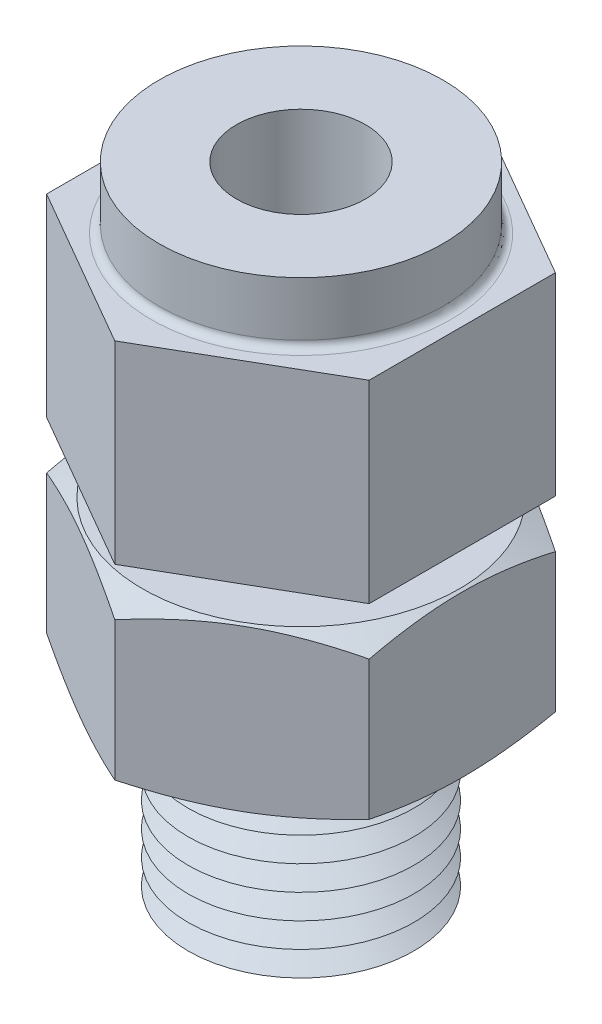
ISO-10303-21;
HEADER;
FILE_DESCRIPTION(('STEP AP214'),'2;1');
FILE_NAME('part.step','',(''),(''),'','','');
FILE_SCHEMA(('AUTOMOTIVE_DESIGN { 1 0 10303 214 1 1 1 1 }'));
ENDSEC;
DATA;
#1=APPLICATION_CONTEXT('core data for automotive mechanical design processes');
#2=APPLICATION_PROTOCOL_DEFINITION('international standard','automotive_design',2000,#1);
#3=PRODUCT_CONTEXT('',#1,'mechanical');
#4=PRODUCT('Part','Part','',(#3));
#5=PRODUCT_RELATED_PRODUCT_CATEGORY('part','',(#4));
#6=PRODUCT_DEFINITION_FORMATION('','',#4);
#7=PRODUCT_DEFINITION_CONTEXT('part definition',#1,'design');
#8=PRODUCT_DEFINITION('design','',#6,#7);
#9=PRODUCT_DEFINITION_SHAPE('','',#8);
#10=(LENGTH_UNIT() NAMED_UNIT(*) SI_UNIT(.MILLI.,.METRE.));
#11=(NAMED_UNIT(*) PLANE_ANGLE_UNIT() SI_UNIT($,.RADIAN.));
#12=(NAMED_UNIT(*) SI_UNIT($,.STERADIAN.) SOLID_ANGLE_UNIT());
#13=UNCERTAINTY_MEASURE_WITH_UNIT(LENGTH_MEASURE(1.E-05),#10,'distance_accuracy_value','');
#14=(GEOMETRIC_REPRESENTATION_CONTEXT(3) GLOBAL_UNCERTAINTY_ASSIGNED_CONTEXT((#13)) GLOBAL_UNIT_ASSIGNED_CONTEXT((#10,
#11,#12)) REPRESENTATION_CONTEXT('',''));
#15=CARTESIAN_POINT('',(0.,0.,0.));
#16=DIRECTION('',(0.,0.,1.));
#17=DIRECTION('',(1.,0.,0.));
#18=AXIS2_PLACEMENT_3D('',#15,#16,#17);
#19=CARTESIAN_POINT('',(0.,22.326593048,0.));
#20=DIRECTION('',(0.,-1.,0.));
#21=DIRECTION('',(0.,0.,-1.));
#22=AXIS2_PLACEMENT_3D('',#19,#20,#21);
#23=CYLINDRICAL_SURFACE('',#22,6.985);
#24=CARTESIAN_POINT('',(0.,19.659593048,0.));
#25=DIRECTION('',(0.,-1.,0.));
#26=DIRECTION('',(0.,0.,-1.));
#27=AXIS2_PLACEMENT_3D('',#24,#25,#26);
#28=CIRCLE('',#27,6.985);
#29=CARTESIAN_POINT('',(0.,19.659593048,-6.98500000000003));
#30=VERTEX_POINT('',#29);
#31=EDGE_CURVE('E38',#30,#30,#28,.F.);
#32=CARTESIAN_POINT('',(0.,22.326593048,0.));
#33=DIRECTION('',(0.,1.,0.));
#34=DIRECTION('',(0.,0.,1.));
#35=AXIS2_PLACEMENT_3D('',#32,#33,#34);
#36=CIRCLE('',#35,6.985);
#37=CARTESIAN_POINT('',(0.,22.326593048,-6.98500000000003));
#38=VERTEX_POINT('',#37);
#39=EDGE_CURVE('E141',#38,#38,#36,.T.);
#40=CARTESIAN_POINT('',(0.,19.659593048,-6.98500000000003));
#41=CARTESIAN_POINT('',(0.,19.687374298,-6.98500000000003));
#42=CARTESIAN_POINT('',(0.,19.715155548,-6.98500000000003));
#43=CARTESIAN_POINT('',(0.,19.770718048,-6.98500000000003));
#44=CARTESIAN_POINT('',(0.,19.798499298,-6.98500000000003));
#45=CARTESIAN_POINT('',(0.,19.854061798,-6.98500000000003));
#46=CARTESIAN_POINT('',(0.,19.881843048,-6.98500000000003));
#47=CARTESIAN_POINT('',(0.,19.937405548,-6.98500000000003));
#48=CARTESIAN_POINT('',(0.,19.965186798,-6.98500000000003));
#49=CARTESIAN_POINT('',(0.,20.020749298,-6.98500000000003));
#50=CARTESIAN_POINT('',(0.,20.048530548,-6.98500000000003));
#51=CARTESIAN_POINT('',(0.,20.104093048,-6.98500000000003));
#52=CARTESIAN_POINT('',(0.,20.131874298,-6.98500000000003));
#53=CARTESIAN_POINT('',(0.,20.187436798,-6.98500000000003));
#54=CARTESIAN_POINT('',(0.,20.215218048,-6.98500000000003));
#55=CARTESIAN_POINT('',(0.,20.270780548,-6.98500000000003));
#56=CARTESIAN_POINT('',(0.,20.298561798,-6.98500000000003));
#57=CARTESIAN_POINT('',(0.,20.354124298,-6.98500000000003));
#58=CARTESIAN_POINT('',(0.,20.381905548,-6.98500000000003));
#59=CARTESIAN_POINT('',(0.,20.437468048,-6.98500000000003));
#60=CARTESIAN_POINT('',(0.,20.465249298,-6.98500000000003));
#61=CARTESIAN_POINT('',(0.,20.520811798,-6.98500000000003));
#62=CARTESIAN_POINT('',(0.,20.548593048,-6.98500000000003));
#63=CARTESIAN_POINT('',(0.,20.604155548,-6.98500000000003));
#64=CARTESIAN_POINT('',(0.,20.631936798,-6.98500000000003));
#65=CARTESIAN_POINT('',(0.,20.687499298,-6.98500000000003));
#66=CARTESIAN_POINT('',(0.,20.715280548,-6.98500000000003));
#67=CARTESIAN_POINT('',(0.,20.770843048,-6.98500000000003));
#68=CARTESIAN_POINT('',(0.,20.798624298,-6.98500000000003));
#69=CARTESIAN_POINT('',(0.,20.854186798,-6.98500000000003));
#70=CARTESIAN_POINT('',(0.,20.881968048,-6.98500000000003));
#71=CARTESIAN_POINT('',(0.,20.937530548,-6.98500000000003));
#72=CARTESIAN_POINT('',(0.,20.965311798,-6.98500000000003));
#73=CARTESIAN_POINT('',(0.,21.020874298,-6.98500000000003));
#74=CARTESIAN_POINT('',(0.,21.048655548,-6.98500000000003));
#75=CARTESIAN_POINT('',(0.,21.104218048,-6.98500000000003));
#76=CARTESIAN_POINT('',(0.,21.131999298,-6.98500000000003));
#77=CARTESIAN_POINT('',(0.,21.187561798,-6.98500000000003));
#78=CARTESIAN_POINT('',(0.,21.215343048,-6.98500000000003));
#79=CARTESIAN_POINT('',(0.,21.270905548,-6.98500000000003));
#80=CARTESIAN_POINT('',(0.,21.298686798,-6.98500000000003));
#81=CARTESIAN_POINT('',(0.,21.354249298,-6.98500000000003));
#82=CARTESIAN_POINT('',(0.,21.382030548,-6.98500000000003));
#83=CARTESIAN_POINT('',(0.,21.437593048,-6.98500000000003));
#84=CARTESIAN_POINT('',(0.,21.465374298,-6.98500000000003));
#85=CARTESIAN_POINT('',(0.,21.520936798,-6.98500000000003));
#86=CARTESIAN_POINT('',(0.,21.548718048,-6.98500000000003));
#87=CARTESIAN_POINT('',(0.,21.604280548,-6.98500000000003));
#88=CARTESIAN_POINT('',(0.,21.632061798,-6.98500000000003));
#89=CARTESIAN_POINT('',(0.,21.687624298,-6.98500000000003));
#90=CARTESIAN_POINT('',(0.,21.715405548,-6.98500000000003));
#91=CARTESIAN_POINT('',(0.,21.770968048,-6.98500000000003));
#92=CARTESIAN_POINT('',(0.,21.798749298,-6.98500000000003));
#93=CARTESIAN_POINT('',(0.,21.854311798,-6.98500000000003));
#94=CARTESIAN_POINT('',(0.,21.882093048,-6.98500000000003));
#95=CARTESIAN_POINT('',(0.,21.937655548,-6.98500000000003));
#96=CARTESIAN_POINT('',(0.,21.965436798,-6.98500000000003));
#97=CARTESIAN_POINT('',(0.,22.020999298,-6.98500000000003));
#98=CARTESIAN_POINT('',(0.,22.048780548,-6.98500000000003));
#99=CARTESIAN_POINT('',(0.,22.104343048,-6.98500000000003));
#100=CARTESIAN_POINT('',(0.,22.132124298,-6.98500000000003));
#101=CARTESIAN_POINT('',(0.,22.187686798,-6.98500000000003));
#102=CARTESIAN_POINT('',(0.,22.215468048,-6.98500000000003));
#103=CARTESIAN_POINT('',(0.,22.271030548,-6.98500000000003));
#104=CARTESIAN_POINT('',(0.,22.298811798,-6.98500000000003));
#105=CARTESIAN_POINT('',(0.,22.326593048,-6.98500000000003));
#106=B_SPLINE_CURVE_WITH_KNOTS('',3,(#40,#41,#42,#43,#44,#45,#46,#47,#48,#49,#50,#51,#52,#53,
#54,#55,#56,#57,#58,#59,#60,#61,#62,#63,#64,#65,#66,#67,#68,#69,#70,#71,#72,#73,#74,#75,#76,#77,
#78,#79,#80,#81,#82,#83,#84,#85,#86,#87,#88,#89,#90,#91,#92,#93,#94,#95,#96,#97,#98,#99,#100,
#101,#102,#103,#104,#105),.UNSPECIFIED.,.F.,.F.,(4,2,2,2,2,2,2,2,2,2,2,2,2,2,2,2,2,2,2,2,2,2,2,
2,2,2,2,2,2,2,2,2,4),(0.,0.0833437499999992,0.166687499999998,0.250031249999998,
0.333374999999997,0.416718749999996,0.500062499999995,0.583406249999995,0.666749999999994,
0.750093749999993,0.833437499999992,0.916781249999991,1.00012499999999,1.08346874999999,
1.16681249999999,1.25015624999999,1.33349999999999,1.41684374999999,1.50018749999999,
1.58353124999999,1.66687499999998,1.75021874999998,1.83356249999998,1.91690624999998,
2.00024999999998,2.08359374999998,2.16693749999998,2.25028124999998,2.33362499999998,
2.41696874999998,2.50031249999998,2.58365624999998,2.66699999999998),.UNSPECIFIED.);
#107=EDGE_CURVE('BSEAM30',#30,#38,#106,.T.);
#108=ORIENTED_EDGE('',*,*,#31,.T.);
#109=ORIENTED_EDGE('',*,*,#39,.F.);
#110=ORIENTED_EDGE('',*,*,#107,.T.);
#111=ORIENTED_EDGE('',*,*,#107,.F.);
#112=EDGE_LOOP('',(#108,#110,#109,#111));
#113=FACE_BOUND('',#112,.T.);
#114=ADVANCED_FACE('F30',(#113),#23,.T.);
#115=CARTESIAN_POINT('',(0.,22.326593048,0.));
#116=DIRECTION('',(0.,1.,0.));
#117=DIRECTION('',(0.,0.,1.));
#118=AXIS2_PLACEMENT_3D('',#115,#116,#117);
#119=PLANE('',#118);
#120=CARTESIAN_POINT('',(0.,22.326593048,0.));
#121=DIRECTION('',(0.,1.,0.));
#122=DIRECTION('',(0.,0.,1.));
#123=AXIS2_PLACEMENT_3D('',#120,#121,#122);
#124=CIRCLE('',#123,3.175);
#125=CARTESIAN_POINT('',(0.,22.326593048,3.17499999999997));
#126=VERTEX_POINT('',#125);
#127=EDGE_CURVE('E658',#126,#126,#124,.T.);
#128=ORIENTED_EDGE('',*,*,#127,.F.);
#129=EDGE_LOOP('',(#128));
#130=FACE_BOUND('',#129,.T.);
#131=ORIENTED_EDGE('',*,*,#39,.T.);
#132=EDGE_LOOP('',(#131));
#133=FACE_BOUND('',#132,.T.);
#134=ADVANCED_FACE('F391',(#130,#133),#119,.T.);
#135=CARTESIAN_POINT('',(15.8749820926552,19.278593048,7.20072985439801E-06));
#136=DIRECTION('',(0.,-1.,0.));
#137=DIRECTION('',(0.,0.,-1.));
#138=AXIS2_PLACEMENT_3D('',#135,#136,#137);
#139=PLANE('',#138);
#140=CARTESIAN_POINT('',(0.,19.278593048,0.));
#141=DIRECTION('',(0.,-1.,0.));
#142=DIRECTION('',(0.,0.,-1.));
#143=AXIS2_PLACEMENT_3D('',#140,#141,#142);
#144=CIRCLE('',#143,7.366);
#145=CARTESIAN_POINT('',(0.,19.278593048,-7.366));
#146=VERTEX_POINT('',#145);
#147=EDGE_CURVE('E11',#146,#146,#144,.T.);
#148=ORIENTED_EDGE('',*,*,#147,.T.);
#149=EDGE_LOOP('',(#148));
#150=FACE_BOUND('',#149,.T.);
#151=DIRECTION('',(0.866025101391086,0.,0.500000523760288));
#152=VECTOR('',#151,1.);
#153=CARTESIAN_POINT('',(6.23601629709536E-06,19.278593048,-9.16542718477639));
#154=LINE('',#153,#152);
#155=CARTESIAN_POINT('',(6.23601629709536E-06,19.278593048,-9.16542718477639));
#156=VERTEX_POINT('',#155);
#157=CARTESIAN_POINT('',(7.93749520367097,19.278593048,-4.58270939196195));
#158=VERTEX_POINT('',#157);
#159=EDGE_CURVE('E124',#156,#158,#154,.T.);
#160=ORIENTED_EDGE('',*,*,#159,.F.);
#161=DIRECTION('',(0.866025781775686,0.,-0.499999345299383));
#162=VECTOR('',#161,1.);
#163=CARTESIAN_POINT('',(-7.93748896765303,19.278593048,-4.58272019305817));
#164=LINE('',#163,#162);
#165=CARTESIAN_POINT('',(-7.93748896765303,19.278593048,-4.58272019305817));
#166=VERTEX_POINT('',#165);
#167=EDGE_CURVE('E130',#166,#156,#164,.T.);
#168=ORIENTED_EDGE('',*,*,#167,.F.);
#169=DIRECTION('',(4.53589792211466E-07,0.,-0.999999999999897));
#170=VECTOR('',#169,1.);
#171=CARTESIAN_POINT('',(-7.93749312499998,19.278593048,4.58271299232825));
#172=LINE('',#171,#170);
#173=CARTESIAN_POINT('',(-7.93749312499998,19.278593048,4.58271299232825));
#174=VERTEX_POINT('',#173);
#175=EDGE_CURVE('E164',#174,#166,#172,.T.);
#176=ORIENTED_EDGE('',*,*,#175,.F.);
#177=DIRECTION('',(-0.866025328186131,0.,-0.50000013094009));
#178=VECTOR('',#177,1.);
#179=CARTESIAN_POINT('',(-2.07867212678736E-06,19.278593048,9.16542718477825));
#180=LINE('',#179,#178);
#181=CARTESIAN_POINT('',(-2.07867212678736E-06,19.278593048,9.16542718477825));
#182=VERTEX_POINT('',#181);
#183=EDGE_CURVE('E161',#182,#174,#180,.T.);
#184=ORIENTED_EDGE('',*,*,#183,.F.);
#185=DIRECTION('',(-0.866025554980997,0.,0.499999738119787));
#186=VECTOR('',#185,1.);
#187=CARTESIAN_POINT('',(7.93749104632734,19.278593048,4.58271659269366));
#188=LINE('',#187,#186);
#189=CARTESIAN_POINT('',(7.93749104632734,19.278593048,4.58271659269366));
#190=VERTEX_POINT('',#189);
#191=EDGE_CURVE('E158',#190,#182,#188,.T.);
#192=ORIENTED_EDGE('',*,*,#191,.F.);
#193=DIRECTION('',(-4.53589792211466E-07,0.,0.999999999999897));
#194=VECTOR('',#193,1.);
#195=CARTESIAN_POINT('',(7.93749520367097,19.278593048,-4.58270939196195));
#196=LINE('',#195,#194);
#197=EDGE_CURVE('E156',#158,#190,#196,.T.);
#198=ORIENTED_EDGE('',*,*,#197,.F.);
#199=EDGE_LOOP('',(#160,#168,#176,#184,#192,#198));
#200=FACE_BOUND('',#199,.T.);
#201=ADVANCED_FACE('F393',(#150,#200),#139,.F.);
#202=CARTESIAN_POINT('',(6.23601629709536E-06,19.278593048,-9.16542718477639));
#203=DIRECTION('',(0.500000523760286,0.,-0.866025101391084));
#204=DIRECTION('',(-0.866025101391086,0.,-0.500000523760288));
#205=AXIS2_PLACEMENT_3D('',#202,#203,#204);
#206=PLANE('',#205);
#207=DIRECTION('',(0.,-1.,0.));
#208=VECTOR('',#207,1.);
#209=CARTESIAN_POINT('',(6.23601629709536E-06,19.278593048,-9.16542718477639));
#210=LINE('',#209,#208);
#211=CARTESIAN_POINT('',(6.2360162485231E-06,9.753593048,-9.16542718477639));
#212=VERTEX_POINT('',#211);
#213=EDGE_CURVE('E176',#156,#212,#210,.T.);
#214=ORIENTED_EDGE('',*,*,#213,.F.);
#215=ORIENTED_EDGE('',*,*,#159,.T.);
#216=DIRECTION('',(0.,-1.,0.));
#217=VECTOR('',#216,1.);
#218=CARTESIAN_POINT('',(7.93749520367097,19.278593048,-4.58270939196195));
#219=LINE('',#218,#217);
#220=CARTESIAN_POINT('',(7.93749520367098,9.753593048,-4.58270939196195));
#221=VERTEX_POINT('',#220);
#222=EDGE_CURVE('E118',#158,#221,#219,.T.);
#223=ORIENTED_EDGE('',*,*,#222,.T.);
#224=DIRECTION('',(0.866025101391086,0.,0.500000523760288));
#225=VECTOR('',#224,1.);
#226=CARTESIAN_POINT('',(6.2360162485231E-06,9.753593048,-9.16542718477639));
#227=LINE('',#226,#225);
#228=EDGE_CURVE('E121',#212,#221,#227,.T.);
#229=ORIENTED_EDGE('',*,*,#228,.F.);
#230=EDGE_LOOP('',(#214,#215,#223,#229));
#231=FACE_BOUND('',#230,.T.);
#232=ADVANCED_FACE('F120',(#231),#206,.T.);
#233=CARTESIAN_POINT('',(-7.93748896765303,19.278593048,-4.58272019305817));
#234=DIRECTION('',(-0.499999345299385,0.,-0.866025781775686));
#235=DIRECTION('',(-0.866025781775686,0.,0.499999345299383));
#236=AXIS2_PLACEMENT_3D('',#233,#234,#235);
#237=PLANE('',#236);
#238=DIRECTION('',(0.,-1.,0.));
#239=VECTOR('',#238,1.);
#240=CARTESIAN_POINT('',(-7.93748896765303,19.278593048,-4.58272019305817));
#241=LINE('',#240,#239);
#242=CARTESIAN_POINT('',(-7.93748896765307,9.753593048,-4.58272019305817));
#243=VERTEX_POINT('',#242);
#244=EDGE_CURVE('E174',#166,#243,#241,.T.);
#245=ORIENTED_EDGE('',*,*,#244,.F.);
#246=ORIENTED_EDGE('',*,*,#167,.T.);
#247=ORIENTED_EDGE('',*,*,#213,.T.);
#248=DIRECTION('',(0.866025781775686,0.,-0.499999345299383));
#249=VECTOR('',#248,1.);
#250=CARTESIAN_POINT('',(-7.93748896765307,9.753593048,-4.58272019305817));
#251=LINE('',#250,#249);
#252=EDGE_CURVE('E140',#243,#212,#251,.T.);
#253=ORIENTED_EDGE('',*,*,#252,.F.);
#254=EDGE_LOOP('',(#245,#246,#247,#253));
#255=FACE_BOUND('',#254,.T.);
#256=ADVANCED_FACE('F415',(#255),#237,.T.);
#257=CARTESIAN_POINT('',(-7.93749312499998,19.278593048,4.58271299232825));
#258=DIRECTION('',(-0.999999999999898,0.,-4.53589794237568E-07));
#259=DIRECTION('',(-4.53589792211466E-07,0.,0.999999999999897));
#260=AXIS2_PLACEMENT_3D('',#257,#258,#259);
#261=PLANE('',#260);
#262=DIRECTION('',(0.,-1.,0.));
#263=VECTOR('',#262,1.);
#264=CARTESIAN_POINT('',(-7.93749312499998,19.278593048,4.58271299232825));
#265=LINE('',#264,#263);
#266=CARTESIAN_POINT('',(-7.93749312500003,9.753593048,4.58271299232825));
#267=VERTEX_POINT('',#266);
#268=EDGE_CURVE('E172',#174,#267,#265,.T.);
#269=ORIENTED_EDGE('',*,*,#268,.F.);
#270=ORIENTED_EDGE('',*,*,#175,.T.);
#271=ORIENTED_EDGE('',*,*,#244,.T.);
#272=DIRECTION('',(4.53589792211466E-07,0.,-0.999999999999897));
#273=VECTOR('',#272,1.);
#274=CARTESIAN_POINT('',(-7.93749312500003,9.753593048,4.58271299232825));
#275=LINE('',#274,#273);
#276=EDGE_CURVE('E152',#267,#243,#275,.T.);
#277=ORIENTED_EDGE('',*,*,#276,.F.);
#278=EDGE_LOOP('',(#269,#270,#271,#277));
#279=FACE_BOUND('',#278,.T.);
#280=ADVANCED_FACE('F425',(#279),#261,.T.);
#281=CARTESIAN_POINT('',(-2.07867212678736E-06,19.278593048,9.16542718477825));
#282=DIRECTION('',(-0.500000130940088,0.,0.866025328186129));
#283=DIRECTION('',(0.866025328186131,0.,0.500000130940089));
#284=AXIS2_PLACEMENT_3D('',#281,#282,#283);
#285=PLANE('',#284);
#286=DIRECTION('',(0.,-1.,0.));
#287=VECTOR('',#286,1.);
#288=CARTESIAN_POINT('',(-2.07867212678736E-06,19.278593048,9.16542718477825));
#289=LINE('',#288,#287);
#290=CARTESIAN_POINT('',(-2.07867212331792E-06,9.753593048,9.16542718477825));
#291=VERTEX_POINT('',#290);
#292=EDGE_CURVE('E170',#182,#291,#289,.T.);
#293=ORIENTED_EDGE('',*,*,#292,.F.);
#294=ORIENTED_EDGE('',*,*,#183,.T.);
#295=ORIENTED_EDGE('',*,*,#268,.T.);
#296=DIRECTION('',(-0.866025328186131,0.,-0.50000013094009));
#297=VECTOR('',#296,1.);
#298=CARTESIAN_POINT('',(-2.07867212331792E-06,9.753593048,9.16542718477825));
#299=LINE('',#298,#297);
#300=EDGE_CURVE('E146',#291,#267,#299,.T.);
#301=ORIENTED_EDGE('',*,*,#300,.F.);
#302=EDGE_LOOP('',(#293,#294,#295,#301));
#303=FACE_BOUND('',#302,.T.);
#304=ADVANCED_FACE('F421',(#303),#285,.T.);
#305=CARTESIAN_POINT('',(7.93749104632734,19.278593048,4.58271659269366));
#306=DIRECTION('',(0.499999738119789,0.,0.866025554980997));
#307=DIRECTION('',(0.866025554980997,0.,-0.499999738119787));
#308=AXIS2_PLACEMENT_3D('',#305,#306,#307);
#309=PLANE('',#308);
#310=DIRECTION('',(0.,-1.,0.));
#311=VECTOR('',#310,1.);
#312=CARTESIAN_POINT('',(7.93749104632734,19.278593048,4.58271659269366));
#313=LINE('',#312,#311);
#314=CARTESIAN_POINT('',(7.93749104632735,9.753593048,4.58271659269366));
#315=VERTEX_POINT('',#314);
#316=EDGE_CURVE('E129',#190,#315,#313,.T.);
#317=ORIENTED_EDGE('',*,*,#316,.F.);
#318=ORIENTED_EDGE('',*,*,#191,.T.);
#319=ORIENTED_EDGE('',*,*,#292,.T.);
#320=DIRECTION('',(-0.866025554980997,0.,0.499999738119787));
#321=VECTOR('',#320,1.);
#322=CARTESIAN_POINT('',(7.93749104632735,9.753593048,4.58271659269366));
#323=LINE('',#322,#321);
#324=EDGE_CURVE('E144',#315,#291,#323,.T.);
#325=ORIENTED_EDGE('',*,*,#324,.F.);
#326=EDGE_LOOP('',(#317,#318,#319,#325));
#327=FACE_BOUND('',#326,.T.);
#328=ADVANCED_FACE('F418',(#327),#309,.T.);
#329=CARTESIAN_POINT('',(7.93749520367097,19.278593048,-4.58270939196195));
#330=DIRECTION('',(0.999999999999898,0.,4.53589794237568E-07));
#331=DIRECTION('',(4.53589792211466E-07,0.,-0.999999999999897));
#332=AXIS2_PLACEMENT_3D('',#329,#330,#331);
#333=PLANE('',#332);
#334=ORIENTED_EDGE('',*,*,#197,.T.);
#335=ORIENTED_EDGE('',*,*,#316,.T.);
#336=DIRECTION('',(-4.53589792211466E-07,0.,0.999999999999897));
#337=VECTOR('',#336,1.);
#338=CARTESIAN_POINT('',(7.93749520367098,9.753593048,-4.58270939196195));
#339=LINE('',#338,#337);
#340=EDGE_CURVE('E136',#221,#315,#339,.T.);
#341=ORIENTED_EDGE('',*,*,#340,.F.);
#342=ORIENTED_EDGE('',*,*,#222,.F.);
#343=EDGE_LOOP('',(#334,#335,#341,#342));
#344=FACE_BOUND('',#343,.T.);
#345=ADVANCED_FACE('F143',(#344),#333,.T.);
#346=CARTESIAN_POINT('',(15.8749820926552,9.753593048,7.20072985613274E-06));
#347=DIRECTION('',(0.,-1.,0.));
#348=DIRECTION('',(0.,0.,-1.));
#349=AXIS2_PLACEMENT_3D('',#346,#347,#348);
#350=PLANE('',#349);
#351=CARTESIAN_POINT('',(0.,9.753593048,0.));
#352=DIRECTION('',(0.,1.,0.));
#353=DIRECTION('',(0.,0.,1.));
#354=AXIS2_PLACEMENT_3D('',#351,#352,#353);
#355=CIRCLE('',#354,5.55625);
#356=CARTESIAN_POINT('',(0.,9.753593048,5.55625));
#357=VERTEX_POINT('',#356);
#358=EDGE_CURVE('E181',#357,#357,#355,.T.);
#359=ORIENTED_EDGE('',*,*,#358,.T.);
#360=EDGE_LOOP('',(#359));
#361=FACE_BOUND('',#360,.T.);
#362=ORIENTED_EDGE('',*,*,#228,.T.);
#363=ORIENTED_EDGE('',*,*,#340,.T.);
#364=ORIENTED_EDGE('',*,*,#324,.T.);
#365=ORIENTED_EDGE('',*,*,#300,.T.);
#366=ORIENTED_EDGE('',*,*,#276,.T.);
#367=ORIENTED_EDGE('',*,*,#252,.T.);
#368=EDGE_LOOP('',(#362,#363,#364,#365,#366,#367));
#369=FACE_BOUND('',#368,.T.);
#370=ADVANCED_FACE('F134',(#361,#369),#350,.T.);
#371=CARTESIAN_POINT('',(7.80105600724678,8.02639304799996,0.));
#372=DIRECTION('',(0.,1.,0.));
#373=DIRECTION('',(0.,0.,1.));
#374=AXIS2_PLACEMENT_3D('',#371,#372,#373);
#375=PLANE('',#374);
#376=CARTESIAN_POINT('',(0.,8.02639304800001,0.));
#377=DIRECTION('',(0.,-1.,0.));
#378=DIRECTION('',(0.,0.,-1.));
#379=AXIS2_PLACEMENT_3D('',#376,#377,#378);
#380=CIRCLE('',#379,7.80105600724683);
#381=CARTESIAN_POINT('',(0.,8.02639304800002,-7.80105600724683));
#382=VERTEX_POINT('',#381);
#383=EDGE_CURVE('E353',#382,#382,#380,.T.);
#384=ORIENTED_EDGE('',*,*,#383,.F.);
#385=EDGE_LOOP('',(#384));
#386=FACE_BOUND('',#385,.T.);
#387=CARTESIAN_POINT('',(0.,8.02639304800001,0.));
#388=DIRECTION('',(0.,1.,0.));
#389=DIRECTION('',(0.,0.,1.));
#390=AXIS2_PLACEMENT_3D('',#387,#388,#389);
#391=CIRCLE('',#390,5.55625);
#392=CARTESIAN_POINT('',(0.,8.02639304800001,5.55625));
#393=VERTEX_POINT('',#392);
#394=EDGE_CURVE('E178',#393,#393,#391,.T.);
#395=ORIENTED_EDGE('',*,*,#394,.F.);
#396=EDGE_LOOP('',(#395));
#397=FACE_BOUND('',#396,.T.);
#398=ADVANCED_FACE('F247',(#386,#397),#375,.T.);
#399=CARTESIAN_POINT('',(0.,0.,0.));
#400=DIRECTION('',(0.,1.,0.));
#401=DIRECTION('',(0.,0.,1.));
#402=AXIS2_PLACEMENT_3D('',#399,#400,#401);
#403=CONICAL_SURFACE('',#402,7.80105600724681,1.18250723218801);
#404=CARTESIAN_POINT('',(0.,0.,0.));
#405=DIRECTION('',(0.,-1.,0.));
#406=DIRECTION('',(0.,0.,-1.));
#407=AXIS2_PLACEMENT_3D('',#404,#405,#406);
#408=CIRCLE('',#407,7.80105600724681);
#409=CARTESIAN_POINT('',(0.,0.,-7.80105600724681));
#410=VERTEX_POINT('',#409);
#411=EDGE_CURVE('E236',#410,#410,#408,.T.);
#412=ORIENTED_EDGE('',*,*,#411,.F.);
#413=EDGE_LOOP('',(#412));
#414=FACE_BOUND('',#413,.T.);
#415=CARTESIAN_POINT('',(0.000197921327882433,0.558151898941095,9.16554265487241));
#416=CARTESIAN_POINT('',(-0.273694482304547,0.493461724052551,9.00741074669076));
#417=CARTESIAN_POINT('',(-0.548499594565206,0.433578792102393,8.84875188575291));
#418=CARTESIAN_POINT('',(-1.09994742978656,0.32522781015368,8.53037321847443));
#419=CARTESIAN_POINT('',(-1.37659112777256,0.276766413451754,8.37065284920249));
#420=CARTESIAN_POINT('',(-1.93135801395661,0.193146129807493,8.05035792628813));
#421=CARTESIAN_POINT('',(-2.20948091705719,0.157984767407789,7.88978353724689));
#422=CARTESIAN_POINT('',(-2.76679313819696,0.102561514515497,7.56801906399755));
#423=CARTESIAN_POINT('',(-3.04598221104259,0.0822963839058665,7.40682912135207));
#424=CARTESIAN_POINT('',(-3.60006162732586,0.0579118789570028,7.08693110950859));
#425=CARTESIAN_POINT('',(-3.87494282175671,0.0535193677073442,6.92822832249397));
#426=CARTESIAN_POINT('',(-4.42458128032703,0.0603526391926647,6.61089429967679));
#427=CARTESIAN_POINT('',(-4.69933853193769,0.0715797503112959,6.45226307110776));
#428=CARTESIAN_POINT('',(-5.24788660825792,0.109057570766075,6.135558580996));
#429=CARTESIAN_POINT('',(-5.521677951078,0.135298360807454,5.97748502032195));
#430=CARTESIAN_POINT('',(-6.06797167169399,0.201544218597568,5.66208208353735));
#431=CARTESIAN_POINT('',(-6.34047417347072,0.241547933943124,5.50475263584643));
#432=CARTESIAN_POINT('',(-6.72298180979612,0.306394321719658,5.28391167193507));
#433=CARTESIAN_POINT('',(-6.83365000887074,0.326185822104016,5.2200173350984));
#434=CARTESIAN_POINT('',(-7.05470450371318,0.367662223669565,5.09239141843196));
#435=CARTESIAN_POINT('',(-7.16509083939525,0.389346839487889,5.02865981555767));
#436=CARTESIAN_POINT('',(-7.38600351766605,0.434578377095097,4.90111577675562));
#437=CARTESIAN_POINT('',(-7.49652882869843,0.458131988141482,4.83730393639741));
#438=CARTESIAN_POINT('',(-7.71731348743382,0.506914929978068,4.70983380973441));
#439=CARTESIAN_POINT('',(-7.8275728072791,0.532144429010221,4.64617553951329));
#440=CARTESIAN_POINT('',(-7.93769312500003,0.558151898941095,4.58259752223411));
#441=B_SPLINE_CURVE_WITH_KNOTS('',3,(#415,#416,#417,#418,#419,#420,#421,#422,#423,#424,#425,
#426,#427,#428,#429,#430,#431,#432,#433,#434,#435,#436,#437,#438,#439,#440),.UNSPECIFIED.,.F.,
.F.,(4,2,2,2,2,2,2,2,2,2,2,2,4),(0.,0.96850252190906,1.93756783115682,2.90645268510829,
3.87512673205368,4.82705021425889,5.7790546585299,6.73043085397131,7.68171358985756,
8.06964063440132,8.45750930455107,8.84683488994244,9.23619961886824),.UNSPECIFIED.);
#442=CARTESIAN_POINT('',(-2.07867212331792E-06,0.55810466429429,9.16542718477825));
#443=VERTEX_POINT('',#442);
#444=CARTESIAN_POINT('',(-7.93749312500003,0.558104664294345,4.58271299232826));
#445=VERTEX_POINT('',#444);
#446=EDGE_CURVE('E198',#443,#445,#441,.T.);
#447=ORIENTED_EDGE('',*,*,#446,.T.);
#448=CARTESIAN_POINT('',(-7.93748545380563,2.80714451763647,-12.3294717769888));
#449=CARTESIAN_POINT('',(-7.93748561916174,2.68179553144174,-11.9649218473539));
#450=CARTESIAN_POINT('',(-7.93748578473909,2.55783901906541,-11.5998841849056));
#451=CARTESIAN_POINT('',(-7.93748611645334,2.31350217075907,-10.8685752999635));
#452=CARTESIAN_POINT('',(-7.93748628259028,2.19312218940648,-10.502303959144));
#453=CARTESIAN_POINT('',(-7.93748661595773,1.95643551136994,-9.76735037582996));
#454=CARTESIAN_POINT('',(-7.93748678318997,1.84014069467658,-9.39866429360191));
#455=CARTESIAN_POINT('',(-7.93748711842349,1.61308104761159,-8.65959669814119));
#456=CARTESIAN_POINT('',(-7.93748728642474,1.5023160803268,-8.28921522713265));
#457=CARTESIAN_POINT('',(-7.9374876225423,1.28824526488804,-7.54819865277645));
#458=CARTESIAN_POINT('',(-7.93748779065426,1.18490648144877,-7.17757311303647));
#459=CARTESIAN_POINT('',(-7.93748812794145,0.986916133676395,-6.43397792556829));
#460=CARTESIAN_POINT('',(-7.93748829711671,0.892264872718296,-6.06100819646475));
#461=CARTESIAN_POINT('',(-7.93748863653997,0.713994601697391,-5.31270376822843));
#462=CARTESIAN_POINT('',(-7.93748880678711,0.630367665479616,-4.93737097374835));
#463=CARTESIAN_POINT('',(-7.93748914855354,0.476824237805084,-4.18390060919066));
#464=CARTESIAN_POINT('',(-7.93748932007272,0.406906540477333,-3.80576328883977));
#465=CARTESIAN_POINT('',(-7.93748962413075,0.298238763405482,-3.13542629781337));
#466=CARTESIAN_POINT('',(-7.9374897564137,0.256023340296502,-2.84379075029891));
#467=CARTESIAN_POINT('',(-7.93749002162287,0.182834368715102,-2.25910136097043));
#468=CARTESIAN_POINT('',(-7.93749015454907,0.15186052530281,-1.96604755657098));
#469=CARTESIAN_POINT('',(-7.93749042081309,0.102355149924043,-1.37903252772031));
#470=CARTESIAN_POINT('',(-7.93749055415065,0.0838170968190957,-1.08507186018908));
#471=CARTESIAN_POINT('',(-7.93749082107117,0.0599535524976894,-0.496609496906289));
#472=CARTESIAN_POINT('',(-7.93749095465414,0.0546279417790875,-0.202107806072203));
#473=CARTESIAN_POINT('',(-7.93749122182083,0.0574312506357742,0.38689726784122));
#474=CARTESIAN_POINT('',(-7.93749135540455,0.0655632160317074,0.68140063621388));
#475=CARTESIAN_POINT('',(-7.93749162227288,0.0949204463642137,1.26974794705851));
#476=CARTESIAN_POINT('',(-7.93749175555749,0.11614586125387,1.56359188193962));
#477=CARTESIAN_POINT('',(-7.93749202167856,0.170810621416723,2.15029172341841));
#478=CARTESIAN_POINT('',(-7.93749215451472,0.20425673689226,2.44314699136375));
#479=CARTESIAN_POINT('',(-7.9374924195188,0.282116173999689,3.0273843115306));
#480=CARTESIAN_POINT('',(-7.93749255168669,0.326529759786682,3.31876632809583));
#481=CARTESIAN_POINT('',(-7.93749285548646,0.43993373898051,3.98853400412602));
#482=CARTESIAN_POINT('',(-7.93749302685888,0.5122884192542,4.36634759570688));
#483=CARTESIAN_POINT('',(-7.93749336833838,0.670241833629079,5.1191852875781));
#484=CARTESIAN_POINT('',(-7.93749353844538,0.755841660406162,5.49420915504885));
#485=CARTESIAN_POINT('',(-7.93749387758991,0.937656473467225,6.24189913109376));
#486=CARTESIAN_POINT('',(-7.93749404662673,1.03387798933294,6.61456363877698));
#487=CARTESIAN_POINT('',(-7.93749438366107,1.234690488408,7.35760138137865));
#488=CARTESIAN_POINT('',(-7.93749455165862,1.33928119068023,7.72797469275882));
#489=CARTESIAN_POINT('',(-7.93749488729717,1.55543607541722,8.46793522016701));
#490=CARTESIAN_POINT('',(-7.93749505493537,1.66702114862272,8.8375163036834));
#491=CARTESIAN_POINT('',(-7.93749538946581,1.89551063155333,9.57503385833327));
#492=CARTESIAN_POINT('',(-7.93749555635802,2.01241516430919,9.9429702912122));
#493=CARTESIAN_POINT('',(-7.93749588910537,2.25018707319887,10.6765567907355));
#494=CARTESIAN_POINT('',(-7.93749605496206,2.37104400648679,11.0422102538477));
#495=CARTESIAN_POINT('',(-7.93749638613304,2.61621181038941,11.7723214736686));
#496=CARTESIAN_POINT('',(-7.93749655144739,2.74052236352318,12.1367793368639));
#497=CARTESIAN_POINT('',(-7.93749671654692,2.86618065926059,12.5007636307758));
#498=B_SPLINE_CURVE_WITH_KNOTS('',3,(#448,#449,#450,#451,#452,#453,#454,#455,#456,#457,#458,
#459,#460,#461,#462,#463,#464,#465,#466,#467,#468,#469,#470,#471,#472,#473,#474,#475,#476,#477,
#478,#479,#480,#481,#482,#483,#484,#485,#486,#487,#488,#489,#490,#491,#492,#493,#494,#495,#496,
#497),.UNSPECIFIED.,.F.,.F.,(4,2,2,2,2,2,2,2,2,2,2,2,2,2,2,2,2,2,2,2,2,2,2,2,4),(0.,
1.15650505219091,2.31312438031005,3.47286769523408,4.63258228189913,5.78678757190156,
6.94103315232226,8.09444428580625,9.24775391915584,10.1315919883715,11.01540686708,
11.8987579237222,12.7821009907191,13.6656440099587,14.5491971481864,15.4332405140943,
16.3173051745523,17.4710326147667,18.6248552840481,19.7793912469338,20.9338884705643,
22.0920154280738,23.2501691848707,24.4054772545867,25.560679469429),.UNSPECIFIED.);
#499=CARTESIAN_POINT('',(-7.93748896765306,0.55810466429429,-4.58272019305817));
#500=VERTEX_POINT('',#499);
#501=EDGE_CURVE('E294',#445,#500,#498,.F.);
#502=ORIENTED_EDGE('',*,*,#501,.T.);
#503=CARTESIAN_POINT('',(-7.93768896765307,0.558151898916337,-4.58260472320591));
#504=CARTESIAN_POINT('',(-7.6637964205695,0.493461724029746,-4.7407363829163));
#505=CARTESIAN_POINT('',(-7.38899116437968,0.433578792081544,-4.89939499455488));
#506=CARTESIAN_POINT('',(-6.83754304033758,0.325227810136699,-5.21777316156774));
#507=CARTESIAN_POINT('',(-6.5608991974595,0.276766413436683,-5.37749327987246));
#508=CARTESIAN_POINT('',(-6.00613202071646,0.193146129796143,-5.69778769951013));
#509=CARTESIAN_POINT('',(-5.72800897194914,0.157984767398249,-5.85836183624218));
#510=CARTESIAN_POINT('',(-5.1706964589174,0.102561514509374,-6.18012580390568));
#511=CARTESIAN_POINT('',(-4.89150723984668,0.0822963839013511,-6.34131549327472));
#512=CARTESIAN_POINT('',(-4.33742753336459,0.0579118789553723,-6.66121300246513));
#513=CARTESIAN_POINT('',(-4.0625461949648,0.0535193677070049,-6.81991554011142));
#514=CARTESIAN_POINT('',(-3.51290744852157,0.0603526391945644,-7.13724906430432));
#515=CARTESIAN_POINT('',(-3.23815005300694,0.0715797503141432,-7.29588004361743));
#516=CARTESIAN_POINT('',(-2.68960168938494,0.109057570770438,-7.61258403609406));
#517=CARTESIAN_POINT('',(-2.41581020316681,0.135298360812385,-7.77065734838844));
#518=CARTESIAN_POINT('',(-1.86951619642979,0.20154421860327,-8.086059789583));
#519=CARTESIAN_POINT('',(-1.59701355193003,0.241547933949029,-8.24338899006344));
#520=CARTESIAN_POINT('',(-1.214505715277,0.306394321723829,-8.46422960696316));
#521=CARTESIAN_POINT('',(-1.10383745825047,0.326185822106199,-8.52812384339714));
#522=CARTESIAN_POINT('',(-0.882782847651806,0.367662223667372,-8.65574955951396));
#523=CARTESIAN_POINT('',(-0.772396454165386,0.389346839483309,-8.71948106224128));
#524=CARTESIAN_POINT('',(-0.551483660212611,0.434578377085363,-8.84702490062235));
#525=CARTESIAN_POINT('',(-0.440958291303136,0.458131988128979,-8.91083664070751));
#526=CARTESIAN_POINT('',(-0.220173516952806,0.506914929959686,-9.03830656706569));
#527=CARTESIAN_POINT('',(-0.10991413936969,0.53214442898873,-9.10196473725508));
#528=CARTESIAN_POINT('',(0.000206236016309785,0.558151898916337,-9.16554265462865));
#529=B_SPLINE_CURVE_WITH_KNOTS('',3,(#503,#504,#505,#506,#507,#508,#509,#510,#511,#512,#513,
#514,#515,#516,#517,#518,#519,#520,#521,#522,#523,#524,#525,#526,#527,#528),.UNSPECIFIED.,.F.,
.F.,(4,2,2,2,2,2,2,2,2,2,2,2,4),(0.,0.968502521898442,1.93756783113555,2.90645268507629,
3.87512673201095,4.82705021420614,5.77905465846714,6.73043085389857,7.68171358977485,
8.06964063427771,8.45750930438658,8.84683488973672,9.2361996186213),.UNSPECIFIED.);
#530=CARTESIAN_POINT('',(6.23601630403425E-06,0.55810466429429,-9.16542718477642));
#531=VERTEX_POINT('',#530);
#532=EDGE_CURVE('E287',#500,#531,#529,.T.);
#533=ORIENTED_EDGE('',*,*,#532,.T.);
#534=CARTESIAN_POINT('',(-0.000193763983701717,0.558151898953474,-9.16554265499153));
#535=CARTESIAN_POINT('',(0.273698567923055,0.493461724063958,-9.00741062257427));
#536=CARTESIAN_POINT('',(0.548503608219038,0.433578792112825,-8.84875163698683));
#537=CARTESIAN_POINT('',(1.09995129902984,0.325227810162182,-8.53037271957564));
#538=CARTESIAN_POINT('',(1.37659492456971,0.2767664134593,-8.37065222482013));
#539=CARTESIAN_POINT('',(1.9313616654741,0.193146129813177,-8.05035705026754));
#540=CARTESIAN_POINT('',(2.20948449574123,0.157984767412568,-7.88978253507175));
#541=CARTESIAN_POINT('',(2.76679657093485,0.102561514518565,-7.56801780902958));
#542=CARTESIAN_POINT('',(3.04598557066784,0.0822963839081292,-7.40682773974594));
#543=CARTESIAN_POINT('',(3.60006484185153,0.057911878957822,-7.08692947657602));
#544=CARTESIAN_POINT('',(3.87494596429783,0.0535193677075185,-6.92822656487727));
#545=CARTESIAN_POINT('',(4.42458427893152,0.0603526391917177,-6.61089229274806));
#546=CARTESIAN_POINT('',(4.69934145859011,0.0715797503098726,-6.45226093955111));
#547=CARTESIAN_POINT('',(5.24788939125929,0.1090575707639,-6.13555620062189));
#548=CARTESIAN_POINT('',(5.52168066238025,0.135298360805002,-5.97748251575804));
#549=CARTESIAN_POINT('',(6.06797423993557,0.201544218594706,-5.66207933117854));
#550=CARTESIAN_POINT('',(6.34047667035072,0.241547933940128,-5.50474975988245));
#551=CARTESIAN_POINT('',(6.72298420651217,0.306394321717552,-5.28390862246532));
#552=CARTESIAN_POINT('',(6.8336523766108,0.326185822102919,-5.22001423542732));
#553=CARTESIAN_POINT('',(7.05470681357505,0.367662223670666,-5.09238821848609));
#554=CARTESIAN_POINT('',(7.16509312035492,0.389346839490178,-5.02865656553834));
#555=CARTESIAN_POINT('',(7.38600574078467,0.434578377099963,-4.90111242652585));
#556=CARTESIAN_POINT('',(7.49653102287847,0.458131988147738,-4.83730053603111));
#557=CARTESIAN_POINT('',(7.71731562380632,0.506914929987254,-4.70983030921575));
#558=CARTESIAN_POINT('',(7.82757491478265,0.532144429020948,-4.6461719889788));
#559=CARTESIAN_POINT('',(7.93769520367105,0.558151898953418,-4.58259392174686));
#560=B_SPLINE_CURVE_WITH_KNOTS('',3,(#534,#535,#536,#537,#538,#539,#540,#541,#542,#543,#544,
#545,#546,#547,#548,#549,#550,#551,#552,#553,#554,#555,#556,#557,#558,#559),.UNSPECIFIED.,.F.,
.F.,(4,2,2,2,2,2,2,2,2,2,2,2,4),(0.,0.968502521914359,1.93756783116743,2.90645268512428,
3.87512673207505,4.82705021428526,5.77905465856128,6.73043085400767,7.68171358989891,
8.06964063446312,8.45750930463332,8.8468348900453,9.23619961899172),.UNSPECIFIED.);
#561=CARTESIAN_POINT('',(7.93749520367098,0.55810466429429,-4.58270939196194));
#562=VERTEX_POINT('',#561);
#563=EDGE_CURVE('E295',#531,#562,#560,.T.);
#564=ORIENTED_EDGE('',*,*,#563,.T.);
#565=CARTESIAN_POINT('',(7.93749871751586,2.80714175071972,-12.3294551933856));
#566=CARTESIAN_POINT('',(7.93749855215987,2.6817928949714,-11.9649055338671));
#567=CARTESIAN_POINT('',(7.93749838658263,2.55783651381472,-11.5998681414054));
#568=CARTESIAN_POINT('',(7.93749805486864,2.31349992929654,-10.8685597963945));
#569=CARTESIAN_POINT('',(7.93749788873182,2.19312008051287,-10.5022887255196));
#570=CARTESIAN_POINT('',(7.93749755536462,1.95643366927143,-9.76733568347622));
#571=CARTESIAN_POINT('',(7.9374973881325,1.84013898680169,-9.39864987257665));
#572=CARTESIAN_POINT('',(7.93749705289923,1.6130796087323,-8.65958282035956));
#573=CARTESIAN_POINT('',(7.93749688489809,1.50231477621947,-8.28920162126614));
#574=CARTESIAN_POINT('',(7.93749654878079,1.28824423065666,-7.54818559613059));
#575=CARTESIAN_POINT('',(7.93749638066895,1.18490558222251,-7.17756033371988));
#576=CARTESIAN_POINT('',(7.93749604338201,0.986915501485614,-6.43396570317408));
#577=CARTESIAN_POINT('',(7.93749587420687,0.892264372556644,-6.06099625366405));
#578=CARTESIAN_POINT('',(7.93749553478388,0.713994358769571,-5.31269238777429));
#579=CARTESIAN_POINT('',(7.9374953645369,0.630367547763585,-4.93735987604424));
#580=CARTESIAN_POINT('',(7.93749502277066,0.476824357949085,-4.18389008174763));
#581=CARTESIAN_POINT('',(7.93749485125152,0.40690677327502,-3.80575304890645));
#582=CARTESIAN_POINT('',(7.93749454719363,0.298239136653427,-3.1354163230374));
#583=CARTESIAN_POINT('',(7.93749441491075,0.256023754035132,-2.84378075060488));
#584=CARTESIAN_POINT('',(7.93749414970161,0.18283486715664,-2.25909131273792));
#585=CARTESIAN_POINT('',(7.93749401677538,0.151861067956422,-1.96603748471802));
#586=CARTESIAN_POINT('',(7.93749375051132,0.102355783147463,-1.37902241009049));
#587=CARTESIAN_POINT('',(7.93749361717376,0.0838177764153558,-1.08506172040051));
#588=CARTESIAN_POINT('',(7.93749335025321,0.0599543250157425,-0.496599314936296));
#589=CARTESIAN_POINT('',(7.93749321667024,0.0546287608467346,-0.202097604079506));
#590=CARTESIAN_POINT('',(7.93749294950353,0.0574321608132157,0.386907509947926));
#591=CARTESIAN_POINT('',(7.9374928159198,0.0655641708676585,0.681410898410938));
#592=CARTESIAN_POINT('',(7.93749254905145,0.0949214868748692,1.26975824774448));
#593=CARTESIAN_POINT('',(7.93749241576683,0.116146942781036,1.56360220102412));
#594=CARTESIAN_POINT('',(7.93749214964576,0.170811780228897,2.15030207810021));
#595=CARTESIAN_POINT('',(7.93749201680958,0.204257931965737,2.44315736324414));
#596=CARTESIAN_POINT('',(7.93749175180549,0.282117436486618,3.02739471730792));
#597=CARTESIAN_POINT('',(7.93749161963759,0.326531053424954,3.31877675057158));
#598=CARTESIAN_POINT('',(7.93749131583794,0.439935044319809,3.98854414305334));
#599=CARTESIAN_POINT('',(7.93749114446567,0.512289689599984,4.36635743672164));
#600=CARTESIAN_POINT('',(7.93749080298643,0.670243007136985,5.11919453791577));
#601=CARTESIAN_POINT('',(7.93749063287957,0.755842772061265,5.49421811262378));
#602=CARTESIAN_POINT('',(7.9374902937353,0.937657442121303,6.24190750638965));
#603=CARTESIAN_POINT('',(7.93749012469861,1.03387887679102,6.61457172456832));
#604=CARTESIAN_POINT('',(7.93748978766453,1.23469120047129,7.35760889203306));
#605=CARTESIAN_POINT('',(7.93748961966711,1.33928180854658,7.72798191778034));
#606=CARTESIAN_POINT('',(7.93748928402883,1.55543649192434,8.46794186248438));
#607=CARTESIAN_POINT('',(7.93748911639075,1.66702145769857,8.83752264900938));
#608=CARTESIAN_POINT('',(7.93748878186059,1.89551071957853,9.57503961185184));
#609=CARTESIAN_POINT('',(7.93748861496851,2.01241513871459,9.94297574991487));
#610=CARTESIAN_POINT('',(7.93748828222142,2.2501868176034,10.6765616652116));
#611=CARTESIAN_POINT('',(7.93748811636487,2.37104363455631,11.0422148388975));
#612=CARTESIAN_POINT('',(7.93748778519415,2.61621120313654,11.7723254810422));
#613=CARTESIAN_POINT('',(7.93748761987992,2.7405216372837,12.1367830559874));
#614=CARTESIAN_POINT('',(7.93748745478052,2.86617981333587,12.5007670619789));
#615=B_SPLINE_CURVE_WITH_KNOTS('',3,(#565,#566,#567,#568,#569,#570,#571,#572,#573,#574,#575,
#576,#577,#578,#579,#580,#581,#582,#583,#584,#585,#586,#587,#588,#589,#590,#591,#592,#593,#594,
#595,#596,#597,#598,#599,#600,#601,#602,#603,#604,#605,#606,#607,#608,#609,#610,#611,#612,#613,
#614),.UNSPECIFIED.,.F.,.F.,(4,2,2,2,2,2,2,2,2,2,2,2,2,2,2,2,2,2,2,2,2,2,2,2,4),(0.,
1.15650415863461,2.3131225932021,3.47286501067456,4.63257869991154,5.78678307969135,
6.94102774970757,8.09443797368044,9.24774669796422,10.1315848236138,11.0153997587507,
11.8987508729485,12.7820939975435,13.6656370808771,14.5491902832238,15.4332337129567,
16.3172984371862,17.4710249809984,18.6248467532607,19.7793818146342,20.9338781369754,
22.0920041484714,23.2501569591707,24.4054640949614,25.5606653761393),.UNSPECIFIED.);
#616=CARTESIAN_POINT('',(7.93749104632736,0.55810466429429,4.58271659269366));
#617=VERTEX_POINT('',#616);
#618=EDGE_CURVE('E380',#562,#617,#615,.T.);
#619=ORIENTED_EDGE('',*,*,#618,.T.);
#620=CARTESIAN_POINT('',(7.9376910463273,0.558151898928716,4.58260112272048));
#621=CARTESIAN_POINT('',(7.66379857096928,0.493461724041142,4.7407329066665));
#622=CARTESIAN_POINT('',(7.38899338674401,0.43357879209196,4.89939164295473));
#623=CARTESIAN_POINT('',(6.83754540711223,0.325227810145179,5.21777006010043));
#624=CARTESIAN_POINT('',(6.56090163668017,0.276766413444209,5.37749030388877));
#625=CARTESIAN_POINT('',(6.00613460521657,0.193146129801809,5.69778497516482));
#626=CARTESIAN_POINT('',(5.72801162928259,0.15798476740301,5.85835923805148));
#627=CARTESIAN_POINT('',(5.17069926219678,0.102561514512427,6.18012345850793));
#628=CARTESIAN_POINT('',(4.89151011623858,0.0822963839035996,6.34131327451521));
#629=CARTESIAN_POINT('',(4.33743055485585,0.0579118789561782,6.66121103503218));
#630=CARTESIAN_POINT('',(4.0625492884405,0.0535193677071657,6.81991369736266));
#631=CARTESIAN_POINT('',(3.51291068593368,0.0603526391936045,7.13724747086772));
#632=CARTESIAN_POINT('',(3.23815336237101,0.0715797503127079,7.29587857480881));
#633=CARTESIAN_POINT('',(2.68960514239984,0.109057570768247,7.61258281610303));
#634=CARTESIAN_POINT('',(2.41581372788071,0.135298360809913,7.77065625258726));
#635=CARTESIAN_POINT('',(1.86951986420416,0.201544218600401,8.08605894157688));
#636=CARTESIAN_POINT('',(1.5970172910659,0.241547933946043,8.24338826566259));
#637=CARTESIAN_POINT('',(1.21450955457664,0.306394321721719,8.46422905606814));
#638=CARTESIAN_POINT('',(1.10384132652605,0.32618582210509,8.52812334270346));
#639=CARTESIAN_POINT('',(0.882786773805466,0.367662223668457,8.6557491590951));
#640=CARTESIAN_POINT('',(0.772400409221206,0.389346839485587,8.71948071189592));
#641=CARTESIAN_POINT('',(0.551487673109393,0.434578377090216,8.8470246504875));
#642=CARTESIAN_POINT('',(0.440962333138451,0.458131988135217,8.91083644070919));
#643=CARTESIAN_POINT('',(0.220177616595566,0.506914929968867,9.0383064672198));
#644=CARTESIAN_POINT('',(0.109918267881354,0.532144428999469,9.10196468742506));
#645=CARTESIAN_POINT('',(-0.0002020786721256,0.558151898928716,9.16554265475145));
#646=B_SPLINE_CURVE_WITH_KNOTS('',3,(#620,#621,#622,#623,#624,#625,#626,#627,#628,#629,#630,
#631,#632,#633,#634,#635,#636,#637,#638,#639,#640,#641,#642,#643,#644,#645),.UNSPECIFIED.,.F.,
.F.,(4,2,2,2,2,2,2,2,2,2,2,2,4),(0.,0.96850252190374,1.93756783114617,2.90645268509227,
3.87512673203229,4.82705021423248,5.77905465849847,6.73043085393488,7.68171358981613,
8.06964063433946,8.45750930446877,8.84683488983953,9.23619961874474),.UNSPECIFIED.);
#647=EDGE_CURVE('E205',#617,#443,#646,.T.);
#648=ORIENTED_EDGE('',*,*,#647,.T.);
#649=EDGE_LOOP('',(#447,#502,#533,#564,#619,#648));
#650=FACE_BOUND('',#649,.T.);
#651=ADVANCED_FACE('F211',(#414,#650),#403,.T.);
#652=CARTESIAN_POINT('',(0.,-9.14399999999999,0.));
#653=DIRECTION('',(0.,-1.,0.));
#654=DIRECTION('',(0.,0.,-1.));
#655=AXIS2_PLACEMENT_3D('',#652,#653,#654);
#656=PLANE('',#655);
#657=CARTESIAN_POINT('',(0.,-9.14399999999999,0.));
#658=DIRECTION('',(0.,1.,0.));
#659=DIRECTION('',(0.,0.,1.));
#660=AXIS2_PLACEMENT_3D('',#657,#658,#659);
#661=CIRCLE('',#660,3.175);
#662=CARTESIAN_POINT('',(0.,-9.14399999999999,3.175));
#663=VERTEX_POINT('',#662);
#664=EDGE_CURVE('E656',#663,#663,#661,.T.);
#665=ORIENTED_EDGE('',*,*,#664,.T.);
#666=EDGE_LOOP('',(#665));
#667=FACE_BOUND('',#666,.T.);
#668=CARTESIAN_POINT('',(0.,-9.14399999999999,0.));
#669=DIRECTION('',(0.,-1.,0.));
#670=DIRECTION('',(0.,0.,-1.));
#671=AXIS2_PLACEMENT_3D('',#668,#669,#670);
#672=CIRCLE('',#671,4.5021143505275);
#673=CARTESIAN_POINT('',(0.,-9.14399999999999,-4.50211435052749));
#674=VERTEX_POINT('',#673);
#675=EDGE_CURVE('E351',#674,#674,#672,.T.);
#676=ORIENTED_EDGE('',*,*,#675,.T.);
#677=EDGE_LOOP('',(#676));
#678=FACE_BOUND('',#677,.T.);
#679=ADVANCED_FACE('F362',(#667,#678),#656,.T.);
#680=CARTESIAN_POINT('',(0.,-9.14399999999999,0.));
#681=DIRECTION('',(0.,1.,0.));
#682=DIRECTION('',(0.,0.,1.));
#683=AXIS2_PLACEMENT_3D('',#680,#681,#682);
#684=CONICAL_SURFACE('',#683,4.5021143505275,1.0471976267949);
#685=CARTESIAN_POINT('',(0.,-8.53539738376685,0.));
#686=DIRECTION('',(0.,-1.,0.));
#687=DIRECTION('',(0.,0.,-1.));
#688=AXIS2_PLACEMENT_3D('',#685,#686,#687);
#689=CIRCLE('',#688,5.5562451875);
#690=CARTESIAN_POINT('',(0.,-8.53539738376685,-5.55624518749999));
#691=VERTEX_POINT('',#690);
#692=EDGE_CURVE('E348',#691,#691,#689,.T.);
#693=ORIENTED_EDGE('',*,*,#692,.T.);
#694=EDGE_LOOP('',(#693));
#695=FACE_BOUND('',#694,.T.);
#696=ORIENTED_EDGE('',*,*,#675,.F.);
#697=EDGE_LOOP('',(#696));
#698=FACE_BOUND('',#697,.T.);
#699=ADVANCED_FACE('F459',(#695,#698),#684,.T.);
#700=CARTESIAN_POINT('',(0.,-8.53539738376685,0.));
#701=DIRECTION('',(0.,-1.,0.));
#702=DIRECTION('',(0.,0.,-1.));
#703=AXIS2_PLACEMENT_3D('',#700,#701,#702);
#704=CONICAL_SURFACE('',#703,5.5562451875,1.0471976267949);
#705=CARTESIAN_POINT('',(0.,-7.92679476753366,0.));
#706=DIRECTION('',(0.,-1.,0.));
#707=DIRECTION('',(0.,0.,-1.));
#708=AXIS2_PLACEMENT_3D('',#705,#706,#707);
#709=CIRCLE('',#708,4.5021143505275);
#710=CARTESIAN_POINT('',(0.,-7.92679476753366,-4.50211435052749));
#711=VERTEX_POINT('',#710);
#712=EDGE_CURVE('E345',#711,#711,#709,.T.);
#713=ORIENTED_EDGE('',*,*,#712,.T.);
#714=EDGE_LOOP('',(#713));
#715=FACE_BOUND('',#714,.T.);
#716=ORIENTED_EDGE('',*,*,#692,.F.);
#717=EDGE_LOOP('',(#716));
#718=FACE_BOUND('',#717,.T.);
#719=ADVANCED_FACE('F466',(#715,#718),#704,.T.);
#720=CARTESIAN_POINT('',(0.,-7.92679476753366,0.));
#721=DIRECTION('',(0.,1.,0.));
#722=DIRECTION('',(0.,0.,1.));
#723=AXIS2_PLACEMENT_3D('',#720,#721,#722);
#724=CONICAL_SURFACE('',#723,4.5021143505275,1.0471976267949);
#725=CARTESIAN_POINT('',(0.,-7.31819215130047,0.));
#726=DIRECTION('',(0.,-1.,0.));
#727=DIRECTION('',(0.,0.,-1.));
#728=AXIS2_PLACEMENT_3D('',#725,#726,#727);
#729=CIRCLE('',#728,5.5562451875);
#730=CARTESIAN_POINT('',(0.,-7.31819215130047,-5.55624518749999));
#731=VERTEX_POINT('',#730);
#732=EDGE_CURVE('E342',#731,#731,#729,.T.);
#733=ORIENTED_EDGE('',*,*,#732,.T.);
#734=EDGE_LOOP('',(#733));
#735=FACE_BOUND('',#734,.T.);
#736=ORIENTED_EDGE('',*,*,#712,.F.);
#737=EDGE_LOOP('',(#736));
#738=FACE_BOUND('',#737,.T.);
#739=ADVANCED_FACE('F474',(#735,#738),#724,.T.);
#740=CARTESIAN_POINT('',(0.,-7.31819215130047,0.));
#741=DIRECTION('',(0.,-1.,0.));
#742=DIRECTION('',(0.,0.,-1.));
#743=AXIS2_PLACEMENT_3D('',#740,#741,#742);
#744=CONICAL_SURFACE('',#743,5.5562451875,1.0471976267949);
#745=CARTESIAN_POINT('',(0.,-6.70958953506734,0.));
#746=DIRECTION('',(0.,-1.,0.));
#747=DIRECTION('',(0.,0.,-1.));
#748=AXIS2_PLACEMENT_3D('',#745,#746,#747);
#749=CIRCLE('',#748,4.5021143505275);
#750=CARTESIAN_POINT('',(0.,-6.70958953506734,-4.50211435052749));
#751=VERTEX_POINT('',#750);
#752=EDGE_CURVE('E339',#751,#751,#749,.T.);
#753=ORIENTED_EDGE('',*,*,#752,.T.);
#754=EDGE_LOOP('',(#753));
#755=FACE_BOUND('',#754,.T.);
#756=ORIENTED_EDGE('',*,*,#732,.F.);
#757=EDGE_LOOP('',(#756));
#758=FACE_BOUND('',#757,.T.);
#759=ADVANCED_FACE('F482',(#755,#758),#744,.T.);
#760=CARTESIAN_POINT('',(0.,-6.70958953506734,0.));
#761=DIRECTION('',(0.,1.,0.));
#762=DIRECTION('',(0.,0.,1.));
#763=AXIS2_PLACEMENT_3D('',#760,#761,#762);
#764=CONICAL_SURFACE('',#763,4.5021143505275,1.0471976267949);
#765=CARTESIAN_POINT('',(0.,-6.10098691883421,0.));
#766=DIRECTION('',(0.,-1.,0.));
#767=DIRECTION('',(0.,0.,-1.));
#768=AXIS2_PLACEMENT_3D('',#765,#766,#767);
#769=CIRCLE('',#768,5.5562451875);
#770=CARTESIAN_POINT('',(0.,-6.1009869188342,-5.55624518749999));
#771=VERTEX_POINT('',#770);
#772=EDGE_CURVE('E336',#771,#771,#769,.T.);
#773=ORIENTED_EDGE('',*,*,#772,.T.);
#774=EDGE_LOOP('',(#773));
#775=FACE_BOUND('',#774,.T.);
#776=ORIENTED_EDGE('',*,*,#752,.F.);
#777=EDGE_LOOP('',(#776));
#778=FACE_BOUND('',#777,.T.);
#779=ADVANCED_FACE('F490',(#775,#778),#764,.T.);
#780=CARTESIAN_POINT('',(0.,-6.10098691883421,0.));
#781=DIRECTION('',(0.,-1.,0.));
#782=DIRECTION('',(0.,0.,-1.));
#783=AXIS2_PLACEMENT_3D('',#780,#781,#782);
#784=CONICAL_SURFACE('',#783,5.5562451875,1.0471976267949);
#785=CARTESIAN_POINT('',(0.,-5.49238430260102,0.));
#786=DIRECTION('',(0.,-1.,0.));
#787=DIRECTION('',(0.,0.,-1.));
#788=AXIS2_PLACEMENT_3D('',#785,#786,#787);
#789=CIRCLE('',#788,4.5021143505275);
#790=CARTESIAN_POINT('',(0.,-5.49238430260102,-4.5021143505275));
#791=VERTEX_POINT('',#790);
#792=EDGE_CURVE('E333',#791,#791,#789,.T.);
#793=ORIENTED_EDGE('',*,*,#792,.T.);
#794=EDGE_LOOP('',(#793));
#795=FACE_BOUND('',#794,.T.);
#796=ORIENTED_EDGE('',*,*,#772,.F.);
#797=EDGE_LOOP('',(#796));
#798=FACE_BOUND('',#797,.T.);
#799=ADVANCED_FACE('F498',(#795,#798),#784,.T.);
#800=CARTESIAN_POINT('',(0.,-5.49238430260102,0.));
#801=DIRECTION('',(0.,1.,0.));
#802=DIRECTION('',(0.,0.,1.));
#803=AXIS2_PLACEMENT_3D('',#800,#801,#802);
#804=CONICAL_SURFACE('',#803,4.5021143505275,1.0471976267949);
#805=CARTESIAN_POINT('',(0.,-4.88378168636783,0.));
#806=DIRECTION('',(0.,-1.,0.));
#807=DIRECTION('',(0.,0.,-1.));
#808=AXIS2_PLACEMENT_3D('',#805,#806,#807);
#809=CIRCLE('',#808,5.5562451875);
#810=CARTESIAN_POINT('',(0.,-4.88378168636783,-5.5562451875));
#811=VERTEX_POINT('',#810);
#812=EDGE_CURVE('E330',#811,#811,#809,.T.);
#813=ORIENTED_EDGE('',*,*,#812,.T.);
#814=EDGE_LOOP('',(#813));
#815=FACE_BOUND('',#814,.T.);
#816=ORIENTED_EDGE('',*,*,#792,.F.);
#817=EDGE_LOOP('',(#816));
#818=FACE_BOUND('',#817,.T.);
#819=ADVANCED_FACE('F506',(#815,#818),#804,.T.);
#820=CARTESIAN_POINT('',(0.,-4.88378168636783,0.));
#821=DIRECTION('',(0.,-1.,0.));
#822=DIRECTION('',(0.,0.,-1.));
#823=AXIS2_PLACEMENT_3D('',#820,#821,#822);
#824=CONICAL_SURFACE('',#823,5.5562451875,1.0471976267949);
#825=CARTESIAN_POINT('',(0.,-4.27517907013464,0.));
#826=DIRECTION('',(0.,-1.,0.));
#827=DIRECTION('',(0.,0.,-1.));
#828=AXIS2_PLACEMENT_3D('',#825,#826,#827);
#829=CIRCLE('',#828,4.5021143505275);
#830=CARTESIAN_POINT('',(0.,-4.27517907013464,-4.5021143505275));
#831=VERTEX_POINT('',#830);
#832=EDGE_CURVE('E327',#831,#831,#829,.T.);
#833=ORIENTED_EDGE('',*,*,#832,.T.);
#834=EDGE_LOOP('',(#833));
#835=FACE_BOUND('',#834,.T.);
#836=ORIENTED_EDGE('',*,*,#812,.F.);
#837=EDGE_LOOP('',(#836));
#838=FACE_BOUND('',#837,.T.);
#839=ADVANCED_FACE('F514',(#835,#838),#824,.T.);
#840=CARTESIAN_POINT('',(0.,-4.27517907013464,0.));
#841=DIRECTION('',(0.,1.,0.));
#842=DIRECTION('',(0.,0.,1.));
#843=AXIS2_PLACEMENT_3D('',#840,#841,#842);
#844=CONICAL_SURFACE('',#843,4.5021143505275,1.0471976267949);
#845=CARTESIAN_POINT('',(0.,-3.6665764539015,0.));
#846=DIRECTION('',(0.,-1.,0.));
#847=DIRECTION('',(0.,0.,-1.));
#848=AXIS2_PLACEMENT_3D('',#845,#846,#847);
#849=CIRCLE('',#848,5.5562451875);
#850=CARTESIAN_POINT('',(0.,-3.6665764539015,-5.55624518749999));
#851=VERTEX_POINT('',#850);
#852=EDGE_CURVE('E324',#851,#851,#849,.T.);
#853=ORIENTED_EDGE('',*,*,#852,.T.);
#854=EDGE_LOOP('',(#853));
#855=FACE_BOUND('',#854,.T.);
#856=ORIENTED_EDGE('',*,*,#832,.F.);
#857=EDGE_LOOP('',(#856));
#858=FACE_BOUND('',#857,.T.);
#859=ADVANCED_FACE('F522',(#855,#858),#844,.T.);
#860=CARTESIAN_POINT('',(0.,-3.6665764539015,0.));
#861=DIRECTION('',(0.,-1.,0.));
#862=DIRECTION('',(0.,0.,-1.));
#863=AXIS2_PLACEMENT_3D('',#860,#861,#862);
#864=CONICAL_SURFACE('',#863,5.5562451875,1.0471976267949);
#865=CARTESIAN_POINT('',(0.,-3.05797383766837,0.));
#866=DIRECTION('',(0.,-1.,0.));
#867=DIRECTION('',(0.,0.,-1.));
#868=AXIS2_PLACEMENT_3D('',#865,#866,#867);
#869=CIRCLE('',#868,4.5021143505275);
#870=CARTESIAN_POINT('',(0.,-3.05797383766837,-4.50211435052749));
#871=VERTEX_POINT('',#870);
#872=EDGE_CURVE('E321',#871,#871,#869,.T.);
#873=ORIENTED_EDGE('',*,*,#872,.T.);
#874=EDGE_LOOP('',(#873));
#875=FACE_BOUND('',#874,.T.);
#876=ORIENTED_EDGE('',*,*,#852,.F.);
#877=EDGE_LOOP('',(#876));
#878=FACE_BOUND('',#877,.T.);
#879=ADVANCED_FACE('F530',(#875,#878),#864,.T.);
#880=CARTESIAN_POINT('',(0.,-3.05797383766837,0.));
#881=DIRECTION('',(0.,1.,0.));
#882=DIRECTION('',(0.,0.,1.));
#883=AXIS2_PLACEMENT_3D('',#880,#881,#882);
#884=CONICAL_SURFACE('',#883,4.5021143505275,1.0471976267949);
#885=CARTESIAN_POINT('',(0.,-2.44937122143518,0.));
#886=DIRECTION('',(0.,-1.,0.));
#887=DIRECTION('',(0.,0.,-1.));
#888=AXIS2_PLACEMENT_3D('',#885,#886,#887);
#889=CIRCLE('',#888,5.5562451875);
#890=CARTESIAN_POINT('',(0.,-2.44937122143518,-5.55624518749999));
#891=VERTEX_POINT('',#890);
#892=EDGE_CURVE('E318',#891,#891,#889,.T.);
#893=ORIENTED_EDGE('',*,*,#892,.T.);
#894=EDGE_LOOP('',(#893));
#895=FACE_BOUND('',#894,.T.);
#896=ORIENTED_EDGE('',*,*,#872,.F.);
#897=EDGE_LOOP('',(#896));
#898=FACE_BOUND('',#897,.T.);
#899=ADVANCED_FACE('F538',(#895,#898),#884,.T.);
#900=CARTESIAN_POINT('',(0.,-2.44937122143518,0.));
#901=DIRECTION('',(0.,-1.,0.));
#902=DIRECTION('',(0.,0.,-1.));
#903=AXIS2_PLACEMENT_3D('',#900,#901,#902);
#904=CONICAL_SURFACE('',#903,5.5562451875,1.0471976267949);
#905=CARTESIAN_POINT('',(0.,-1.84076860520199,0.));
#906=DIRECTION('',(0.,-1.,0.));
#907=DIRECTION('',(0.,0.,-1.));
#908=AXIS2_PLACEMENT_3D('',#905,#906,#907);
#909=CIRCLE('',#908,4.5021143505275);
#910=CARTESIAN_POINT('',(0.,-1.84076860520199,-4.5021143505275));
#911=VERTEX_POINT('',#910);
#912=EDGE_CURVE('E315',#911,#911,#909,.T.);
#913=ORIENTED_EDGE('',*,*,#912,.T.);
#914=EDGE_LOOP('',(#913));
#915=FACE_BOUND('',#914,.T.);
#916=ORIENTED_EDGE('',*,*,#892,.F.);
#917=EDGE_LOOP('',(#916));
#918=FACE_BOUND('',#917,.T.);
#919=ADVANCED_FACE('F546',(#915,#918),#904,.T.);
#920=CARTESIAN_POINT('',(0.,-1.84076860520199,0.));
#921=DIRECTION('',(0.,1.,0.));
#922=DIRECTION('',(0.,0.,1.));
#923=AXIS2_PLACEMENT_3D('',#920,#921,#922);
#924=CONICAL_SURFACE('',#923,4.5021143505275,1.03478148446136);
#925=CARTESIAN_POINT('',(0.,-1.21443273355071,0.));
#926=DIRECTION('',(0.,-1.,0.));
#927=DIRECTION('',(0.,0.,-1.));
#928=AXIS2_PLACEMENT_3D('',#925,#926,#927);
#929=CIRCLE('',#928,5.55650672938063);
#930=CARTESIAN_POINT('',(0.,-1.21443273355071,-5.55650672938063));
#931=VERTEX_POINT('',#930);
#932=EDGE_CURVE('E312',#931,#931,#929,.T.);
#933=ORIENTED_EDGE('',*,*,#932,.T.);
#934=EDGE_LOOP('',(#933));
#935=FACE_BOUND('',#934,.T.);
#936=ORIENTED_EDGE('',*,*,#912,.F.);
#937=EDGE_LOOP('',(#936));
#938=FACE_BOUND('',#937,.T.);
#939=ADVANCED_FACE('F554',(#935,#938),#924,.T.);
#940=CARTESIAN_POINT('',(0.,-1.21443273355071,0.));
#941=DIRECTION('',(0.,-1.,0.));
#942=DIRECTION('',(0.,0.,-1.));
#943=AXIS2_PLACEMENT_3D('',#940,#941,#942);
#944=CONICAL_SURFACE('',#943,5.55650672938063,1.04719762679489);
#945=CARTESIAN_POINT('',(0.,-0.586269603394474,0.));
#946=DIRECTION('',(0.,-1.,0.));
#947=DIRECTION('',(0.,0.,-1.));
#948=AXIS2_PLACEMENT_3D('',#945,#946,#947);
#949=CIRCLE('',#948,4.46849608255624);
#950=CARTESIAN_POINT('',(0.,-0.586269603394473,-4.46849608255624));
#951=VERTEX_POINT('',#950);
#952=EDGE_CURVE('E309',#951,#951,#949,.T.);
#953=ORIENTED_EDGE('',*,*,#952,.T.);
#954=EDGE_LOOP('',(#953));
#955=FACE_BOUND('',#954,.T.);
#956=ORIENTED_EDGE('',*,*,#932,.F.);
#957=EDGE_LOOP('',(#956));
#958=FACE_BOUND('',#957,.T.);
#959=ADVANCED_FACE('F562',(#955,#958),#944,.T.);
#960=CARTESIAN_POINT('',(0.,-0.586269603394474,0.));
#961=DIRECTION('',(0.,1.,0.));
#962=DIRECTION('',(0.,0.,1.));
#963=AXIS2_PLACEMENT_3D('',#960,#961,#962);
#964=CONICAL_SURFACE('',#963,4.46849608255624,1.08717596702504);
#965=CARTESIAN_POINT('',(0.,-0.0149607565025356,0.));
#966=DIRECTION('',(0.,-1.,0.));
#967=DIRECTION('',(0.,0.,-1.));
#968=AXIS2_PLACEMENT_3D('',#965,#966,#967);
#969=CIRCLE('',#968,5.5562451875);
#970=CARTESIAN_POINT('',(0.,-0.0149607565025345,-5.55624518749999));
#971=VERTEX_POINT('',#970);
#972=EDGE_CURVE('E304',#971,#971,#969,.T.);
#973=ORIENTED_EDGE('',*,*,#972,.T.);
#974=EDGE_LOOP('',(#973));
#975=FACE_BOUND('',#974,.T.);
#976=ORIENTED_EDGE('',*,*,#952,.F.);
#977=EDGE_LOOP('',(#976));
#978=FACE_BOUND('',#977,.T.);
#979=ADVANCED_FACE('F570',(#975,#978),#964,.T.);
#980=CARTESIAN_POINT('',(0.,0.,0.));
#981=DIRECTION('',(0.,-1.,0.));
#982=DIRECTION('',(0.,0.,-1.));
#983=AXIS2_PLACEMENT_3D('',#980,#981,#982);
#984=CYLINDRICAL_SURFACE('',#983,5.5562451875);
#985=CARTESIAN_POINT('',(0.,0.,0.));
#986=DIRECTION('',(0.,-1.,0.));
#987=DIRECTION('',(0.,0.,-1.));
#988=AXIS2_PLACEMENT_3D('',#985,#986,#987);
#989=CIRCLE('',#988,5.5562451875);
#990=CARTESIAN_POINT('',(0.,0.,-5.5562451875));
#991=VERTEX_POINT('',#990);
#992=EDGE_CURVE('E235',#991,#991,#989,.T.);
#993=ORIENTED_EDGE('',*,*,#992,.T.);
#994=EDGE_LOOP('',(#993));
#995=FACE_BOUND('',#994,.T.);
#996=ORIENTED_EDGE('',*,*,#972,.F.);
#997=EDGE_LOOP('',(#996));
#998=FACE_BOUND('',#997,.T.);
#999=ADVANCED_FACE('F283',(#995,#998),#984,.T.);
#1000=CARTESIAN_POINT('',(0.,0.,0.));
#1001=DIRECTION('',(0.,-1.,0.));
#1002=DIRECTION('',(0.,0.,-1.));
#1003=AXIS2_PLACEMENT_3D('',#1000,#1001,#1002);
#1004=PLANE('',#1003);
#1005=ORIENTED_EDGE('',*,*,#992,.F.);
#1006=EDGE_LOOP('',(#1005));
#1007=FACE_BOUND('',#1006,.T.);
#1008=ORIENTED_EDGE('',*,*,#411,.T.);
#1009=EDGE_LOOP('',(#1008));
#1010=FACE_BOUND('',#1009,.T.);
#1011=ADVANCED_FACE('F32',(#1007,#1010),#1004,.T.);
#1012=CARTESIAN_POINT('',(-7.93748896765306,0.,-4.58272019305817));
#1013=DIRECTION('',(-0.999999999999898,0.,-4.53589794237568E-07));
#1014=DIRECTION('',(-4.53589792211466E-07,0.,0.999999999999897));
#1015=AXIS2_PLACEMENT_3D('',#1012,#1013,#1014);
#1016=PLANE('',#1015);
#1017=DIRECTION('',(0.,1.,0.));
#1018=VECTOR('',#1017,1.);
#1019=CARTESIAN_POINT('',(-7.93749312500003,0.,4.58271299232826));
#1020=LINE('',#1019,#1018);
#1021=CARTESIAN_POINT('',(-7.93749312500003,7.39017642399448,4.58271299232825));
#1022=VERTEX_POINT('',#1021);
#1023=EDGE_CURVE('E45',#445,#1022,#1020,.T.);
#1024=ORIENTED_EDGE('',*,*,#1023,.T.);
#1025=CARTESIAN_POINT('',(-7.93748548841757,4.85625378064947,-12.2531649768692));
#1026=CARTESIAN_POINT('',(-7.93748565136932,4.99681139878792,-11.8939158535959));
#1027=CARTESIAN_POINT('',(-7.93748581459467,5.13585558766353,-11.5340635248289));
#1028=CARTESIAN_POINT('',(-7.93748614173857,5.41005464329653,-10.8128305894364));
#1029=CARTESIAN_POINT('',(-7.93748630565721,5.5452090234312,-10.4514497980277));
#1030=CARTESIAN_POINT('',(-7.93748663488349,5.81120750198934,-9.72562596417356));
#1031=CARTESIAN_POINT('',(-7.93748680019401,5.94203437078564,-9.36117658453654));
#1032=CARTESIAN_POINT('',(-7.93748713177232,6.19763605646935,-8.63016739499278));
#1033=CARTESIAN_POINT('',(-7.93748729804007,6.32241107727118,-8.26360765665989));
#1034=CARTESIAN_POINT('',(-7.93748763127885,6.56401494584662,-7.52893774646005));
#1035=CARTESIAN_POINT('',(-7.93748779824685,6.68086389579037,-7.16083421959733));
#1036=CARTESIAN_POINT('',(-7.93748813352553,6.90494464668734,-6.421667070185));
#1037=CARTESIAN_POINT('',(-7.93748830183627,7.01217591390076,-6.05060328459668));
#1038=CARTESIAN_POINT('',(-7.93748863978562,7.21430631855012,-5.30554825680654));
#1039=CARTESIAN_POINT('',(-7.93748880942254,7.30921907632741,-4.9315607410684));
#1040=CARTESIAN_POINT('',(-7.93748915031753,7.48366557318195,-4.18001170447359));
#1041=CARTESIAN_POINT('',(-7.93748932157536,7.56320161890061,-3.80245072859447));
#1042=CARTESIAN_POINT('',(-7.93748960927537,7.68032450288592,-3.16817715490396));
#1043=CARTESIAN_POINT('',(-7.93748972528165,7.72311550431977,-2.91242558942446));
#1044=CARTESIAN_POINT('',(-7.93748995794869,7.79901302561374,-2.39947964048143));
#1045=CARTESIAN_POINT('',(-7.93749007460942,7.83211978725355,-2.14228529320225));
#1046=CARTESIAN_POINT('',(-7.93749030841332,7.88764062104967,-1.62683301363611));
#1047=CARTESIAN_POINT('',(-7.93749042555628,7.91005875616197,-1.3685755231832));
#1048=CARTESIAN_POINT('',(-7.93749066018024,7.94346116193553,-0.851315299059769));
#1049=CARTESIAN_POINT('',(-7.93749077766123,7.95444550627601,-0.592312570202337));
#1050=CARTESIAN_POINT('',(-7.937491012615,7.96457528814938,-0.0743252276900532));
#1051=CARTESIAN_POINT('',(-7.93749113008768,7.96373224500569,0.184659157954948));
#1052=CARTESIAN_POINT('',(-7.93749136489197,7.95026672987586,0.70231694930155));
#1053=CARTESIAN_POINT('',(-7.93749148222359,7.93764426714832,0.96099035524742));
#1054=CARTESIAN_POINT('',(-7.93749171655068,7.90107070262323,1.47759609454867));
#1055=CARTESIAN_POINT('',(-7.93749183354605,7.87711667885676,1.73552821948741));
#1056=CARTESIAN_POINT('',(-7.93749206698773,7.81867854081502,2.25018192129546));
#1057=CARTESIAN_POINT('',(-7.93749218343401,7.78419408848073,2.50690345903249));
#1058=CARTESIAN_POINT('',(-7.93749264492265,7.62823777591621,3.52431749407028));
#1059=CARTESIAN_POINT('',(-7.9374929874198,7.46943611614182,4.27939880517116));
#1060=CARTESIAN_POINT('',(-7.93749349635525,7.18949920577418,5.40141579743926));
#1061=CARTESIAN_POINT('',(-7.93749366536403,7.08911073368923,5.77401849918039));
#1062=CARTESIAN_POINT('',(-7.93749400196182,6.87727796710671,6.51609381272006));
#1063=CARTESIAN_POINT('',(-7.93749416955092,6.76583435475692,6.88556661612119));
#1064=CARTESIAN_POINT('',(-7.93749450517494,6.53307696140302,7.6254951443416));
#1065=CARTESIAN_POINT('',(-7.93749467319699,6.41167410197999,7.99592245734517));
#1066=CARTESIAN_POINT('',(-7.93749500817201,6.16186450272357,8.73442015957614));
#1067=CARTESIAN_POINT('',(-7.93749517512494,6.03345746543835,9.10249044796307));
#1068=CARTESIAN_POINT('',(-7.93749550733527,5.77172565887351,9.83489300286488));
#1069=CARTESIAN_POINT('',(-7.93749567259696,5.63842721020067,10.1992347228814));
#1070=CARTESIAN_POINT('',(-7.93749600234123,5.36739871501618,10.9262005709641));
#1071=CARTESIAN_POINT('',(-7.93749616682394,5.22966939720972,11.2888249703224));
#1072=CARTESIAN_POINT('',(-7.93749633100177,5.0902315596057,11.6507772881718));
#1073=B_SPLINE_CURVE_WITH_KNOTS('',3,(#1025,#1026,#1027,#1028,#1029,#1030,#1031,#1032,#1033,
#1034,#1035,#1036,#1037,#1038,#1039,#1040,#1041,#1042,#1043,#1044,#1045,#1046,#1047,#1048,#1049,
#1050,#1051,#1052,#1053,#1054,#1055,#1056,#1057,#1058,#1059,#1060,#1061,#1062,#1063,#1064,#1065,
#1066,#1067,#1068,#1069,#1070,#1071,#1072),.UNSPECIFIED.,.F.,.F.,(4,2,2,2,2,2,2,2,2,2,2,2,2,2,2,
2,2,2,2,2,2,2,2,4),(0.,1.15731377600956,2.31477171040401,3.47638795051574,4.63796502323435,
5.79647650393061,6.9550522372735,8.11233583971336,9.26944570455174,10.0472080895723,
10.8249510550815,11.6023981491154,12.3798402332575,13.1565251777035,13.933209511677,
14.7100942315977,15.4870038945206,17.797669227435,18.9553021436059,20.1128636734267,
21.2822319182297,22.4516498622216,23.6155008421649,24.7791613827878),.UNSPECIFIED.);
#1074=CARTESIAN_POINT('',(-7.93748896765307,7.39017642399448,-4.58272019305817));
#1075=VERTEX_POINT('',#1074);
#1076=EDGE_CURVE('E272',#1075,#1022,#1073,.T.);
#1077=ORIENTED_EDGE('',*,*,#1076,.F.);
#1078=DIRECTION('',(0.,1.,0.));
#1079=VECTOR('',#1078,1.);
#1080=CARTESIAN_POINT('',(-7.93748896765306,0.,-4.58272019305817));
#1081=LINE('',#1080,#1079);
#1082=EDGE_CURVE('E195',#500,#1075,#1081,.T.);
#1083=ORIENTED_EDGE('',*,*,#1082,.F.);
#1084=ORIENTED_EDGE('',*,*,#501,.F.);
#1085=EDGE_LOOP('',(#1024,#1077,#1083,#1084));
#1086=FACE_BOUND('',#1085,.T.);
#1087=ADVANCED_FACE('F220',(#1086),#1016,.T.);
#1088=CARTESIAN_POINT('',(6.23601630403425E-06,0.,-9.16542718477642));
#1089=DIRECTION('',(-0.499999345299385,0.,-0.866025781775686));
#1090=DIRECTION('',(-0.866025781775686,0.,0.499999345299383));
#1091=AXIS2_PLACEMENT_3D('',#1088,#1089,#1090);
#1092=PLANE('',#1091);
#1093=ORIENTED_EDGE('',*,*,#1082,.T.);
#1094=CARTESIAN_POINT('',(0.000206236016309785,7.3901225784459,-9.16554265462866));
#1095=CARTESIAN_POINT('',(-0.239838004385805,7.4547473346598,-9.02695328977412));
#1096=CARTESIAN_POINT('',(-0.480767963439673,7.51522194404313,-8.88785255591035));
#1097=CARTESIAN_POINT('',(-0.964435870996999,7.62643033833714,-8.60860724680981));
#1098=CARTESIAN_POINT('',(-1.2071747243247,7.67715885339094,-8.46846214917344));
#1099=CARTESIAN_POINT('',(-1.69446597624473,7.76740389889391,-8.18712490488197));
#1100=CARTESIAN_POINT('',(-1.93901986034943,7.80690988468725,-8.04593190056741));
#1101=CARTESIAN_POINT('',(-2.42938136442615,7.87325159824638,-7.76282204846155));
#1102=CARTESIAN_POINT('',(-2.6751887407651,7.90008969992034,-7.62090534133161));
#1103=CARTESIAN_POINT('',(-3.16254351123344,7.93961310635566,-7.33953142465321));
#1104=CARTESIAN_POINT('',(-3.40407355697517,7.9525803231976,-7.20008423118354));
#1105=CARTESIAN_POINT('',(-3.88741219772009,7.9647949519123,-6.92102902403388));
#1106=CARTESIAN_POINT('',(-4.12922080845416,7.96404154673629,-6.78142100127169));
#1107=CARTESIAN_POINT('',(-4.61228448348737,7.94885289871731,-6.50252454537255));
#1108=CARTESIAN_POINT('',(-4.85353985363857,7.93443040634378,-6.36323593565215));
#1109=CARTESIAN_POINT('',(-5.33516902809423,7.89252452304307,-6.08516768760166));
#1110=CARTESIAN_POINT('',(-5.57554291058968,7.86504232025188,-5.94638800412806));
#1111=CARTESIAN_POINT('',(-5.99307315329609,7.80672256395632,-5.70532722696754));
#1112=CARTESIAN_POINT('',(-6.17051893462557,7.77858590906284,-5.60287903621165));
#1113=CARTESIAN_POINT('',(-6.52459932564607,7.71623645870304,-5.39845098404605));
#1114=CARTESIAN_POINT('',(-6.70123396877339,7.68202391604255,-5.29647110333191));
#1115=CARTESIAN_POINT('',(-7.05505676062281,7.60778366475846,-5.09219177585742));
#1116=CARTESIAN_POINT('',(-7.23223779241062,7.56771107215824,-4.98989643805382));
#1117=CARTESIAN_POINT('',(-7.58566301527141,7.4825418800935,-4.78584664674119));
#1118=CARTESIAN_POINT('',(-7.76190735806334,7.43744612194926,-4.68409210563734));
#1119=CARTESIAN_POINT('',(-7.93768896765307,7.39012257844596,-4.58260472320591));
#1120=B_SPLINE_CURVE_WITH_KNOTS('',3,(#1094,#1095,#1096,#1097,#1098,#1099,#1100,#1101,#1102,
#1103,#1104,#1105,#1106,#1107,#1108,#1109,#1110,#1111,#1112,#1113,#1114,#1115,#1116,#1117,#1118,
#1119),.UNSPECIFIED.,.F.,.F.,(4,2,2,2,2,2,2,2,2,2,2,2,4),(0.,0.853887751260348,1.70823592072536,
2.56338419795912,3.41837216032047,4.25563243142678,5.09294256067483,5.92947241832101,
6.76592618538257,7.38629394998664,8.00663590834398,8.63200568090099,9.25727086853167),.UNSPECIFIED.);
#1121=CARTESIAN_POINT('',(6.2360162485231E-06,7.39017642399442,-9.16542718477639));
#1122=VERTEX_POINT('',#1121);
#1123=EDGE_CURVE('E266',#1122,#1075,#1120,.T.);
#1124=ORIENTED_EDGE('',*,*,#1123,.F.);
#1125=DIRECTION('',(0.,1.,0.));
#1126=VECTOR('',#1125,1.);
#1127=CARTESIAN_POINT('',(6.23601630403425E-06,0.,-9.16542718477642));
#1128=LINE('',#1127,#1126);
#1129=EDGE_CURVE('E192',#531,#1122,#1128,.T.);
#1130=ORIENTED_EDGE('',*,*,#1129,.F.);
#1131=ORIENTED_EDGE('',*,*,#532,.F.);
#1132=EDGE_LOOP('',(#1093,#1124,#1130,#1131));
#1133=FACE_BOUND('',#1132,.T.);
#1134=ADVANCED_FACE('F276',(#1133),#1092,.T.);
#1135=CARTESIAN_POINT('',(7.93749520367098,0.,-4.58270939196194));
#1136=DIRECTION('',(0.500000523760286,0.,-0.866025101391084));
#1137=DIRECTION('',(-0.866025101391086,0.,-0.500000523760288));
#1138=AXIS2_PLACEMENT_3D('',#1135,#1136,#1137);
#1139=PLANE('',#1138);
#1140=ORIENTED_EDGE('',*,*,#1129,.T.);
#1141=CARTESIAN_POINT('',(7.93769520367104,7.3901225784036,-4.58259392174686));
#1142=CARTESIAN_POINT('',(7.69765115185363,7.45474733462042,-4.72118361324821));
#1143=CARTESIAN_POINT('',(7.4567213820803,7.51522194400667,-4.86028467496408));
#1144=CARTESIAN_POINT('',(6.97305385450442,7.6264303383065,-5.13953064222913));
#1145=CARTESIAN_POINT('',(6.73031519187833,7.67715885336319,-5.27967607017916));
#1146=CARTESIAN_POINT('',(6.24302432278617,7.76740389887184,-5.56101397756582));
#1147=CARTESIAN_POINT('',(5.9984706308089,7.80690988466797,-5.70220731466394));
#1148=CARTESIAN_POINT('',(5.50810951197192,7.87325159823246,-5.98531783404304));
#1149=CARTESIAN_POINT('',(5.26230232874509,7.90008969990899,-6.12723487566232));
#1150=CARTESIAN_POINT('',(4.77494794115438,7.93961310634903,-6.40860945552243));
#1151=CARTESIAN_POINT('',(4.53341808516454,7.95258032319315,-6.54805697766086));
#1152=CARTESIAN_POINT('',(4.05007982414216,7.9647949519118,-6.82711284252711));
#1153=CARTESIAN_POINT('',(3.80827140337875,7.96404154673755,-6.96672119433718));
#1154=CARTESIAN_POINT('',(3.32520810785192,7.94885289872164,-7.24561830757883));
#1155=CARTESIAN_POINT('',(3.0839529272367,7.93443040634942,-7.38490724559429));
#1156=CARTESIAN_POINT('',(2.60232413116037,7.89252452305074,-7.6629761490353));
#1157=CARTESIAN_POINT('',(2.36195043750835,7.86504232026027,-7.80175615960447));
#1158=CARTESIAN_POINT('',(1.94442052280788,7.80672256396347,-8.04281750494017));
#1159=CARTESIAN_POINT('',(1.76697488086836,7.77858590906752,-8.14526593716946));
#1160=CARTESIAN_POINT('',(1.41289476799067,7.71623645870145,-8.34969447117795));
#1161=CARTESIAN_POINT('',(1.23626026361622,7.68202391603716,-8.45167459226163));
#1162=CARTESIAN_POINT('',(0.882437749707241,7.6077836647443,-8.65595440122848));
#1163=CARTESIAN_POINT('',(0.705256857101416,7.56771107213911,-8.75824998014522));
#1164=CARTESIAN_POINT('',(0.351831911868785,7.48254188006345,-8.96230025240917));
#1165=CARTESIAN_POINT('',(0.175587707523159,7.43744612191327,-9.06405503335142));
#1166=CARTESIAN_POINT('',(-0.000193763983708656,7.3901225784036,-9.16554265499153));
#1167=B_SPLINE_CURVE_WITH_KNOTS('',3,(#1141,#1142,#1143,#1144,#1145,#1146,#1147,#1148,#1149,
#1150,#1151,#1152,#1153,#1154,#1155,#1156,#1157,#1158,#1159,#1160,#1161,#1162,#1163,#1164,#1165,
#1166),.UNSPECIFIED.,.F.,.F.,(4,2,2,2,2,2,2,2,2,2,2,2,4),(0.,0.853887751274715,1.70823592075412,
2.56338419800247,3.41837216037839,4.25563243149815,5.09294256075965,5.92947241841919,
6.76592618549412,7.38629395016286,8.0066359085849,8.6320056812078,9.25727086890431),.UNSPECIFIED.);
#1168=CARTESIAN_POINT('',(7.93749520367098,7.39017642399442,-4.58270939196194));
#1169=VERTEX_POINT('',#1168);
#1170=EDGE_CURVE('E260',#1169,#1122,#1167,.T.);
#1171=ORIENTED_EDGE('',*,*,#1170,.F.);
#1172=DIRECTION('',(0.,1.,0.));
#1173=VECTOR('',#1172,1.);
#1174=CARTESIAN_POINT('',(7.93749520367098,0.,-4.58270939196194));
#1175=LINE('',#1174,#1173);
#1176=EDGE_CURVE('E189',#562,#1169,#1175,.T.);
#1177=ORIENTED_EDGE('',*,*,#1176,.F.);
#1178=ORIENTED_EDGE('',*,*,#563,.F.);
#1179=EDGE_LOOP('',(#1140,#1171,#1177,#1178));
#1180=FACE_BOUND('',#1179,.T.);
#1181=ADVANCED_FACE('F280',(#1180),#1139,.T.);
#1182=CARTESIAN_POINT('',(7.93749104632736,0.,4.58271659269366));
#1183=DIRECTION('',(0.999999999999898,0.,4.53589794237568E-07));
#1184=DIRECTION('',(4.53589792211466E-07,0.,-0.999999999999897));
#1185=AXIS2_PLACEMENT_3D('',#1182,#1183,#1184);
#1186=PLANE('',#1185);
#1187=ORIENTED_EDGE('',*,*,#1176,.T.);
#1188=CARTESIAN_POINT('',(7.93749868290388,4.85625687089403,-12.2531485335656));
#1189=CARTESIAN_POINT('',(7.93749851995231,4.99681434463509,-11.8938996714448));
#1190=CARTESIAN_POINT('',(7.93749835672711,5.13585838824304,-11.5340476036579));
#1191=CARTESIAN_POINT('',(7.93749802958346,5.41005715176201,-10.8128151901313));
#1192=CARTESIAN_POINT('',(7.93749786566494,5.54521138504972,-10.4514346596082));
#1193=CARTESIAN_POINT('',(7.93749753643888,5.81120956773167,-9.72561134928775));
#1194=CARTESIAN_POINT('',(7.93749737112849,5.94203628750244,-9.3611622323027));
#1195=CARTESIAN_POINT('',(7.93749703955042,6.19763767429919,-8.63015356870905));
#1196=CARTESIAN_POINT('',(7.93749687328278,6.32241254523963,-8.26359409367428));
#1197=CARTESIAN_POINT('',(7.93749654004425,6.56401611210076,-7.52892471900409));
#1198=CARTESIAN_POINT('',(7.93749637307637,6.68086491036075,-7.16082146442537));
#1199=CARTESIAN_POINT('',(7.93749603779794,6.9049453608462,-6.42165486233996));
#1200=CARTESIAN_POINT('',(7.93749586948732,7.01217647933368,-6.0505913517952));
#1201=CARTESIAN_POINT('',(7.93749553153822,7.21430659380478,-5.30553687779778));
#1202=CARTESIAN_POINT('',(7.93749536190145,7.3092192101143,-4.93154964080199));
#1203=CARTESIAN_POINT('',(7.93749502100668,7.48366543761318,-4.18000116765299));
#1204=CARTESIAN_POINT('',(7.93749484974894,7.56320135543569,-3.80244047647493));
#1205=CARTESIAN_POINT('',(7.93749456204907,7.68032408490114,-3.16816716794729));
#1206=CARTESIAN_POINT('',(7.9374944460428,7.72311504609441,-2.91241557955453));
#1207=CARTESIAN_POINT('',(7.93749421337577,7.79901248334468,-2.39946958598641));
#1208=CARTESIAN_POINT('',(7.93749409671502,7.83211920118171,-2.1422752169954));
#1209=CARTESIAN_POINT('',(7.9374938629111,7.8876399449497,-1.62682289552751));
#1210=CARTESIAN_POINT('',(7.93749374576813,7.91005803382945,-1.36856538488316));
#1211=CARTESIAN_POINT('',(7.93749351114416,7.94346034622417,-0.851305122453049));
#1212=CARTESIAN_POINT('',(7.93749339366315,7.95444464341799,-0.592302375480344));
#1213=CARTESIAN_POINT('',(7.93749315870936,7.96457433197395,-0.074314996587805));
#1214=CARTESIAN_POINT('',(7.93749304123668,7.96373124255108,0.184669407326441));
#1215=CARTESIAN_POINT('',(7.93749280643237,7.95026563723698,0.702327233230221));
#1216=CARTESIAN_POINT('',(7.93749268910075,7.93764313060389,0.961000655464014));
#1217=CARTESIAN_POINT('',(7.93749245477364,7.9010694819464,1.47760642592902));
#1218=CARTESIAN_POINT('',(7.93749233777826,7.87711541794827,1.73553856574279));
#1219=CARTESIAN_POINT('',(7.93749210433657,7.81867720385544,2.2501922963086));
#1220=CARTESIAN_POINT('',(7.93749198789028,7.78419271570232,2.50691384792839));
#1221=CARTESIAN_POINT('',(7.93749152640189,7.62823636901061,3.52432729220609));
#1222=CARTESIAN_POINT('',(7.93749118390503,7.46943480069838,4.27940800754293));
#1223=CARTESIAN_POINT('',(7.93749067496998,7.18949810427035,5.40142412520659));
#1224=CARTESIAN_POINT('',(7.93749050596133,7.0891097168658,5.77402653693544));
#1225=CARTESIAN_POINT('',(7.9374901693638,6.87727713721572,6.51610127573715));
#1226=CARTESIAN_POINT('',(7.93749000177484,6.76583362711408,6.88557379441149));
#1227=CARTESIAN_POINT('',(7.93748966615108,6.53307645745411,7.62550173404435));
#1228=CARTESIAN_POINT('',(7.93748949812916,6.41167372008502,7.99592874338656));
#1229=CARTESIAN_POINT('',(7.93748916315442,6.16186437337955,8.73442584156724));
#1230=CARTESIAN_POINT('',(7.93748899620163,6.03345746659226,9.10249582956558));
#1231=CARTESIAN_POINT('',(7.93748866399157,5.77172592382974,9.83489779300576));
#1232=CARTESIAN_POINT('',(7.93748849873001,5.63842760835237,10.1992392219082));
#1233=CARTESIAN_POINT('',(7.93748816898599,5.36739938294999,10.926204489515));
#1234=CARTESIAN_POINT('',(7.9374880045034,5.22967020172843,11.2888285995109));
#1235=CARTESIAN_POINT('',(7.93748784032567,5.09023250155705,11.6507806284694));
#1236=B_SPLINE_CURVE_WITH_KNOTS('',3,(#1188,#1189,#1190,#1191,#1192,#1193,#1194,#1195,#1196,
#1197,#1198,#1199,#1200,#1201,#1202,#1203,#1204,#1205,#1206,#1207,#1208,#1209,#1210,#1211,#1212,
#1213,#1214,#1215,#1216,#1217,#1218,#1219,#1220,#1221,#1222,#1223,#1224,#1225,#1226,#1227,#1228,
#1229,#1230,#1231,#1232,#1233,#1234,#1235),.UNSPECIFIED.,.F.,.F.,(4,2,2,2,2,2,2,2,2,2,2,2,2,2,2,
2,2,2,2,2,2,2,2,4),(0.,1.1573128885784,2.31476993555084,3.47638528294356,4.63796146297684,
5.79647202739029,6.95504684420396,8.11232953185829,9.26943848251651,10.0472009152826,
10.8249439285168,11.602391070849,12.3798332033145,13.1565182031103,13.9332025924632,
14.7100873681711,15.4869970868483,17.7976606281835,18.9552926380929,20.1128532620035,
21.2822205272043,22.4516374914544,23.6154875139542,24.779147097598),.UNSPECIFIED.);
#1237=CARTESIAN_POINT('',(7.93749104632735,7.39017642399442,4.58271659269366));
#1238=VERTEX_POINT('',#1237);
#1239=EDGE_CURVE('E255',#1238,#1169,#1236,.F.);
#1240=ORIENTED_EDGE('',*,*,#1239,.F.);
#1241=DIRECTION('',(0.,1.,0.));
#1242=VECTOR('',#1241,1.);
#1243=CARTESIAN_POINT('',(7.93749104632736,0.,4.58271659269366));
#1244=LINE('',#1243,#1242);
#1245=EDGE_CURVE('E186',#617,#1238,#1244,.T.);
#1246=ORIENTED_EDGE('',*,*,#1245,.F.);
#1247=ORIENTED_EDGE('',*,*,#618,.F.);
#1248=EDGE_LOOP('',(#1187,#1240,#1246,#1247));
#1249=FACE_BOUND('',#1248,.T.);
#1250=ADVANCED_FACE('F379',(#1249),#1186,.T.);
#1251=CARTESIAN_POINT('',(-2.07867212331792E-06,0.,9.16542718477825));
#1252=DIRECTION('',(0.499999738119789,0.,0.866025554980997));
#1253=DIRECTION('',(0.866025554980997,0.,-0.499999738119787));
#1254=AXIS2_PLACEMENT_3D('',#1251,#1252,#1253);
#1255=PLANE('',#1254);
#1256=ORIENTED_EDGE('',*,*,#1245,.T.);
#1257=CARTESIAN_POINT('',(-0.0002020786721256,7.39012257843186,9.16554265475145));
#1258=CARTESIAN_POINT('',(0.239842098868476,7.45474733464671,9.0269531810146));
#1259=CARTESIAN_POINT('',(0.480771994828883,7.515221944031,8.88785233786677));
#1260=CARTESIAN_POINT('',(0.964439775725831,7.62643033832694,8.60860680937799));
#1261=CARTESIAN_POINT('',(1.20717856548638,7.6771588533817,8.46846160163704));
#1262=CARTESIAN_POINT('',(1.69446968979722,7.76740389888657,8.18712413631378));
#1263=CARTESIAN_POINT('',(1.93902350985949,7.80690988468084,8.04593102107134));
#1264=CARTESIAN_POINT('',(2.42938488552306,7.87325159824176,7.76282094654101));
#1265=CARTESIAN_POINT('',(2.67519219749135,7.90008969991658,7.6209041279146));
#1266=CARTESIAN_POINT('',(3.16254684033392,7.93961310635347,7.33952999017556));
#1267=CARTESIAN_POINT('',(3.40407682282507,7.95258032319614,7.20008268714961));
#1268=CARTESIAN_POINT('',(3.88741533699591,7.96479495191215,6.92102726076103));
#1269=CARTESIAN_POINT('',(4.12922388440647,7.96404154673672,6.78141912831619));
#1270=CARTESIAN_POINT('',(4.61228743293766,7.94885289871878,6.50252245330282));
#1271=CARTESIAN_POINT('',(4.85354273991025,7.9344304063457,6.3632337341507));
#1272=CARTESIAN_POINT('',(5.33517178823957,7.89252452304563,6.08516526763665));
#1273=CARTESIAN_POINT('',(5.57554560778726,7.86504232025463,5.94638547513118));
#1274=CARTESIAN_POINT('',(5.99307574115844,7.80672256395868,5.70532450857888));
#1275=CARTESIAN_POINT('',(6.17052147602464,7.7785859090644,5.60287623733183));
#1276=CARTESIAN_POINT('',(6.52460177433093,7.71623645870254,5.39844802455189));
#1277=CARTESIAN_POINT('',(6.70123637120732,7.68202391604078,5.29646806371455));
#1278=CARTESIAN_POINT('',(7.05505907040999,7.60778366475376,5.09218857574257));
#1279=CARTESIAN_POINT('',(7.23224005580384,7.56771107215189,4.9898931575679));
#1280=CARTESIAN_POINT('',(7.58566518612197,7.48254188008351,4.78584320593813));
#1281=CARTESIAN_POINT('',(7.76190948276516,7.43744612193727,4.68408858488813));
#1282=CARTESIAN_POINT('',(7.9376910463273,7.3901225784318,4.58260112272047));
#1283=B_SPLINE_CURVE_WITH_KNOTS('',3,(#1257,#1258,#1259,#1260,#1261,#1262,#1263,#1264,#1265,
#1266,#1267,#1268,#1269,#1270,#1271,#1272,#1273,#1274,#1275,#1276,#1277,#1278,#1279,#1280,#1281,
#1282),.UNSPECIFIED.,.F.,.F.,(4,2,2,2,2,2,2,2,2,2,2,2,4),(0.,0.853887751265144,1.70823592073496,
2.56338419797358,3.41837216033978,4.25563243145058,5.09294256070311,5.92947241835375,
6.76592618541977,7.38629395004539,8.00663590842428,8.63200568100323,9.25727086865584),.UNSPECIFIED.);
#1284=CARTESIAN_POINT('',(-2.07867212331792E-06,7.39017642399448,9.16542718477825));
#1285=VERTEX_POINT('',#1284);
#1286=EDGE_CURVE('E234',#1285,#1238,#1283,.T.);
#1287=ORIENTED_EDGE('',*,*,#1286,.F.);
#1288=DIRECTION('',(0.,1.,0.));
#1289=VECTOR('',#1288,1.);
#1290=CARTESIAN_POINT('',(-2.07867212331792E-06,0.,9.16542718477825));
#1291=LINE('',#1290,#1289);
#1292=EDGE_CURVE('E50',#443,#1285,#1291,.T.);
#1293=ORIENTED_EDGE('',*,*,#1292,.F.);
#1294=ORIENTED_EDGE('',*,*,#647,.F.);
#1295=EDGE_LOOP('',(#1256,#1287,#1293,#1294));
#1296=FACE_BOUND('',#1295,.T.);
#1297=ADVANCED_FACE('F219',(#1296),#1255,.T.);
#1298=CARTESIAN_POINT('',(-7.93749312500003,0.,4.58271299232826));
#1299=DIRECTION('',(-0.500000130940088,0.,0.866025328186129));
#1300=DIRECTION('',(0.866025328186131,0.,0.500000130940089));
#1301=AXIS2_PLACEMENT_3D('',#1298,#1299,#1300);
#1302=PLANE('',#1301);
#1303=ORIENTED_EDGE('',*,*,#1292,.T.);
#1304=CARTESIAN_POINT('',(-7.93769312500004,7.39012257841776,4.5825975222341));
#1305=CARTESIAN_POINT('',(-7.69764901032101,7.45474733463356,4.72118710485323));
#1306=CARTESIAN_POINT('',(-7.45671917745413,7.51522194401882,4.8602880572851));
#1307=CARTESIAN_POINT('',(-6.97305152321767,7.6264303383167,5.13953380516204));
#1308=CARTESIAN_POINT('',(-6.73031279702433,7.67715885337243,5.27967912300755));
#1309=CARTESIAN_POINT('',(-6.24302180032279,7.76740389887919,5.56101680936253));
#1310=CARTESIAN_POINT('',(-5.99846804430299,7.80690988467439,5.70221003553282));
#1311=CARTESIAN_POINT('',(-5.50810679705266,7.8732515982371,5.98532033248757));
#1312=CARTESIAN_POINT('',(-5.26229954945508,7.90008969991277,6.12723726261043));
#1313=CARTESIAN_POINT('',(-4.77494503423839,7.93961310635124,6.40861162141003));
#1314=CARTESIAN_POINT('',(-4.53341511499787,7.95258032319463,6.54805903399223));
#1315=CARTESIAN_POINT('',(-4.05007672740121,7.96479495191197,6.82711467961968));
#1316=CARTESIAN_POINT('',(-3.8082682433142,7.96404154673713,6.96672292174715));
#1317=CARTESIAN_POINT('',(-3.32520482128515,7.9488528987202,7.24561981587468));
#1318=CARTESIAN_POINT('',(-3.08394957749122,7.93443040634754,7.38490864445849));
#1319=CARTESIAN_POINT('',(-2.60232065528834,7.8925245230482,7.66297732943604));
#1320=CARTESIAN_POINT('',(-2.36194689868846,7.86504232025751,7.80175723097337));
#1321=CARTESIAN_POINT('',(-1.9444168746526,7.80672256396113,8.04281838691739));
#1322=CARTESIAN_POINT('',(-1.76697118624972,7.77858590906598,8.14526673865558));
#1323=CARTESIAN_POINT('',(-1.41289098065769,7.71623645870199,8.34969511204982));
#1324=CARTESIAN_POINT('',(-1.23625643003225,7.68202391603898,8.45167515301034));
#1325=CARTESIAN_POINT('',(-0.882433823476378,7.60778366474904,8.65595480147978));
#1326=CARTESIAN_POINT('',(-0.705252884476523,7.5677110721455,8.7582503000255));
#1327=CARTESIAN_POINT('',(-0.351827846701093,7.48254188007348,8.96230041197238));
#1328=CARTESIAN_POINT('',(-0.175583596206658,7.43744612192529,9.06405511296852));
#1329=CARTESIAN_POINT('',(0.000197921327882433,7.39012257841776,9.16554265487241));
#1330=B_SPLINE_CURVE_WITH_KNOTS('',3,(#1304,#1305,#1306,#1307,#1308,#1309,#1310,#1311,#1312,
#1313,#1314,#1315,#1316,#1317,#1318,#1319,#1320,#1321,#1322,#1323,#1324,#1325,#1326,#1327,#1328,
#1329),.UNSPECIFIED.,.F.,.F.,(4,2,2,2,2,2,2,2,2,2,2,2,4),(0.,0.853887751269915,1.70823592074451,
2.563384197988,3.41837216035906,4.25563243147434,5.09294256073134,5.92947241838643,
6.7659261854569,7.38629395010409,8.00663590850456,8.6320056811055,9.25727086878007),.UNSPECIFIED.);
#1331=EDGE_CURVE('E227',#1022,#1285,#1330,.T.);
#1332=ORIENTED_EDGE('',*,*,#1331,.F.);
#1333=ORIENTED_EDGE('',*,*,#1023,.F.);
#1334=ORIENTED_EDGE('',*,*,#446,.F.);
#1335=EDGE_LOOP('',(#1303,#1332,#1333,#1334));
#1336=FACE_BOUND('',#1335,.T.);
#1337=ADVANCED_FACE('F214',(#1336),#1302,.T.);
#1338=CARTESIAN_POINT('',(0.,7.39017642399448,0.));
#1339=DIRECTION('',(0.,-1.,0.));
#1340=DIRECTION('',(0.,0.,-1.));
#1341=AXIS2_PLACEMENT_3D('',#1338,#1339,#1340);
#1342=CONICAL_SURFACE('',#1341,9.1654271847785,1.1344640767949);
#1343=ORIENTED_EDGE('',*,*,#383,.T.);
#1344=EDGE_LOOP('',(#1343));
#1345=FACE_BOUND('',#1344,.T.);
#1346=ORIENTED_EDGE('',*,*,#1123,.T.);
#1347=ORIENTED_EDGE('',*,*,#1076,.T.);
#1348=ORIENTED_EDGE('',*,*,#1331,.T.);
#1349=ORIENTED_EDGE('',*,*,#1286,.T.);
#1350=ORIENTED_EDGE('',*,*,#1239,.T.);
#1351=ORIENTED_EDGE('',*,*,#1170,.T.);
#1352=EDGE_LOOP('',(#1346,#1347,#1348,#1349,#1350,#1351));
#1353=FACE_BOUND('',#1352,.T.);
#1354=ADVANCED_FACE('F218',(#1345,#1353),#1342,.T.);
#1355=CARTESIAN_POINT('',(0.,9.753593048,0.));
#1356=DIRECTION('',(0.,-1.,0.));
#1357=DIRECTION('',(0.,0.,-1.));
#1358=AXIS2_PLACEMENT_3D('',#1355,#1356,#1357);
#1359=CYLINDRICAL_SURFACE('',#1358,5.55625);
#1360=ORIENTED_EDGE('',*,*,#358,.F.);
#1361=EDGE_LOOP('',(#1360));
#1362=FACE_BOUND('',#1361,.T.);
#1363=ORIENTED_EDGE('',*,*,#394,.T.);
#1364=EDGE_LOOP('',(#1363));
#1365=FACE_BOUND('',#1364,.T.);
#1366=ADVANCED_FACE('F245',(#1362,#1365),#1359,.T.);
#1367=CARTESIAN_POINT('',(0.,-9.14399999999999,0.));
#1368=DIRECTION('',(0.,1.,0.));
#1369=DIRECTION('',(0.,0.,1.));
#1370=AXIS2_PLACEMENT_3D('',#1367,#1368,#1369);
#1371=CYLINDRICAL_SURFACE('',#1370,3.175);
#1372=ORIENTED_EDGE('',*,*,#664,.F.);
#1373=EDGE_LOOP('',(#1372));
#1374=FACE_BOUND('',#1373,.T.);
#1375=ORIENTED_EDGE('',*,*,#127,.T.);
#1376=EDGE_LOOP('',(#1375));
#1377=FACE_BOUND('',#1376,.T.);
#1378=ADVANCED_FACE('F407',(#1374,#1377),#1371,.F.);
#1379=CARTESIAN_POINT('',(0.,19.659593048,0.));
#1380=DIRECTION('',(0.,-1.,0.));
#1381=DIRECTION('',(0.,0.,-1.));
#1382=AXIS2_PLACEMENT_3D('',#1379,#1380,#1381);
#1383=TOROIDAL_SURFACE('',#1382,7.366,0.381);
#1384=ORIENTED_EDGE('',*,*,#147,.F.);
#1385=EDGE_LOOP('',(#1384));
#1386=FACE_BOUND('',#1385,.T.);
#1387=ORIENTED_EDGE('',*,*,#31,.F.);
#1388=EDGE_LOOP('',(#1387));
#1389=FACE_BOUND('',#1388,.T.);
#1390=ADVANCED_FACE('F437',(#1386,#1389),#1383,.F.);
#1391=CLOSED_SHELL('',(#114,#134,#201,#232,#256,#280,#304,#328,#345,#370,#398,#651,#679,#699,
#719,#739,#759,#779,#799,#819,#839,#859,#879,#899,#919,#939,#959,#979,#999,#1011,#1087,#1134,
#1181,#1250,#1297,#1337,#1354,#1366,#1378,#1390));
#1392=MANIFOLD_SOLID_BREP('B2',#1391);
#1393=ADVANCED_BREP_SHAPE_REPRESENTATION('',(#18,#1392),#14);
#1394=SHAPE_DEFINITION_REPRESENTATION(#9,#1393);
ENDSEC;
END-ISO-10303-21;
